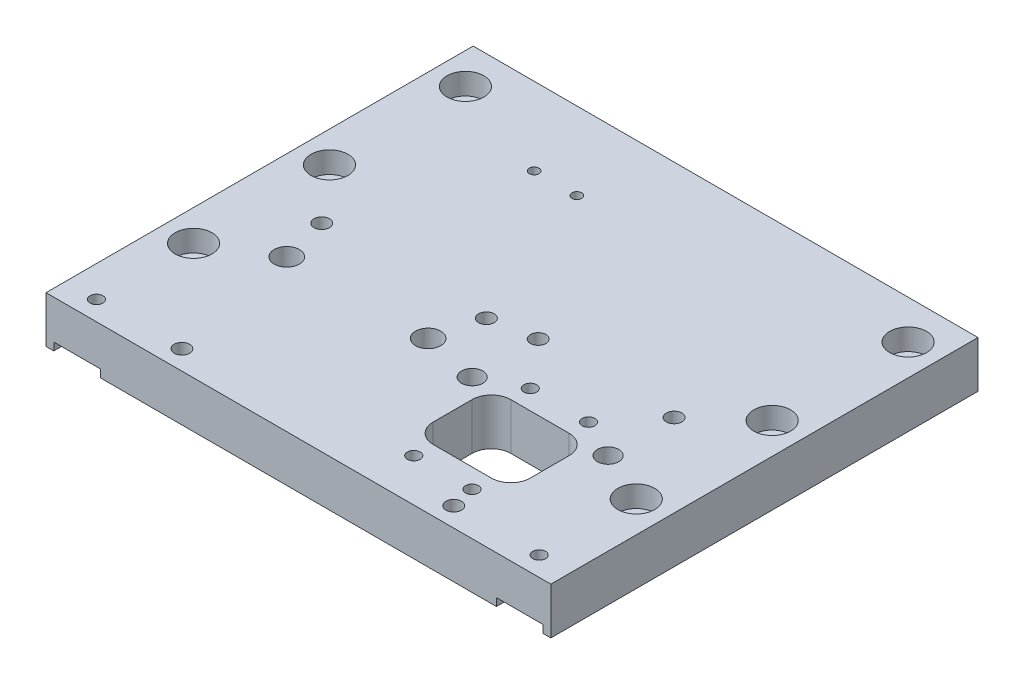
ISO-10303-21;
HEADER;
FILE_DESCRIPTION(('STEP AP214'),'2;1');
FILE_NAME('part.step','',(''),(''),'','','');
FILE_SCHEMA(('AUTOMOTIVE_DESIGN { 1 0 10303 214 1 1 1 1 }'));
ENDSEC;
DATA;
#1=APPLICATION_CONTEXT('core data for automotive mechanical design processes');
#2=APPLICATION_PROTOCOL_DEFINITION('international standard','automotive_design',2000,#1);
#3=PRODUCT_CONTEXT('',#1,'mechanical');
#4=PRODUCT('Part','Part','',(#3));
#5=PRODUCT_RELATED_PRODUCT_CATEGORY('part','',(#4));
#6=PRODUCT_DEFINITION_FORMATION('','',#4);
#7=PRODUCT_DEFINITION_CONTEXT('part definition',#1,'design');
#8=PRODUCT_DEFINITION('design','',#6,#7);
#9=PRODUCT_DEFINITION_SHAPE('','',#8);
#10=(LENGTH_UNIT() NAMED_UNIT(*) SI_UNIT(.MILLI.,.METRE.));
#11=(NAMED_UNIT(*) PLANE_ANGLE_UNIT() SI_UNIT($,.RADIAN.));
#12=(NAMED_UNIT(*) SI_UNIT($,.STERADIAN.) SOLID_ANGLE_UNIT());
#13=UNCERTAINTY_MEASURE_WITH_UNIT(LENGTH_MEASURE(1.E-05),#10,'distance_accuracy_value','');
#14=(GEOMETRIC_REPRESENTATION_CONTEXT(3) GLOBAL_UNCERTAINTY_ASSIGNED_CONTEXT((#13)) GLOBAL_UNIT_ASSIGNED_CONTEXT((#10,
#11,#12)) REPRESENTATION_CONTEXT('',''));
#15=CARTESIAN_POINT('',(0.,0.,0.));
#16=DIRECTION('',(0.,0.,1.));
#17=DIRECTION('',(1.,0.,0.));
#18=AXIS2_PLACEMENT_3D('',#15,#16,#17);
#19=CARTESIAN_POINT('',(108.700000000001,-97.9999999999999,73.9599999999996));
#20=DIRECTION('',(0.,1.,0.));
#21=DIRECTION('',(0.,0.,1.));
#22=AXIS2_PLACEMENT_3D('',#19,#20,#21);
#23=CYLINDRICAL_SURFACE('',#22,2.75);
#24=CARTESIAN_POINT('',(108.700000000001,12.0000000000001,73.9599999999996));
#25=DIRECTION('',(0.,1.,0.));
#26=DIRECTION('',(0.,0.,1.));
#27=AXIS2_PLACEMENT_3D('',#24,#25,#26);
#28=CIRCLE('',#27,2.75);
#29=CARTESIAN_POINT('',(108.700000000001,12.0000000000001,76.7099999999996));
#30=VERTEX_POINT('',#29);
#31=EDGE_CURVE('E307',#30,#30,#28,.T.);
#32=ORIENTED_EDGE('',*,*,#31,.T.);
#33=EDGE_LOOP('',(#32));
#34=FACE_BOUND('',#33,.T.);
#35=CARTESIAN_POINT('',(108.700000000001,6.50000000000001,73.9599999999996));
#36=DIRECTION('',(0.,-1.,0.));
#37=DIRECTION('',(0.,0.,-1.));
#38=AXIS2_PLACEMENT_3D('',#35,#36,#37);
#39=CIRCLE('',#38,2.75);
#40=CARTESIAN_POINT('',(108.700000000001,6.50000000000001,71.2099999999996));
#41=VERTEX_POINT('',#40);
#42=EDGE_CURVE('E36',#41,#41,#39,.F.);
#43=ORIENTED_EDGE('',*,*,#42,.F.);
#44=EDGE_LOOP('',(#43));
#45=FACE_BOUND('',#44,.T.);
#46=ADVANCED_FACE('F32',(#34,#45),#23,.F.);
#47=CARTESIAN_POINT('',(73.7000000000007,-97.9999999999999,73.9599999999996));
#48=DIRECTION('',(0.,1.,0.));
#49=DIRECTION('',(0.,0.,1.));
#50=AXIS2_PLACEMENT_3D('',#47,#48,#49);
#51=CYLINDRICAL_SURFACE('',#50,2.75);
#52=CARTESIAN_POINT('',(73.7000000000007,12.0000000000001,73.9599999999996));
#53=DIRECTION('',(0.,1.,0.));
#54=DIRECTION('',(0.,0.,1.));
#55=AXIS2_PLACEMENT_3D('',#52,#53,#54);
#56=CIRCLE('',#55,2.75);
#57=CARTESIAN_POINT('',(73.7000000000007,12.0000000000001,76.7099999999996));
#58=VERTEX_POINT('',#57);
#59=EDGE_CURVE('E310',#58,#58,#56,.T.);
#60=ORIENTED_EDGE('',*,*,#59,.T.);
#61=EDGE_LOOP('',(#60));
#62=FACE_BOUND('',#61,.T.);
#63=CARTESIAN_POINT('',(73.7000000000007,6.50000000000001,73.9599999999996));
#64=DIRECTION('',(0.,-1.,0.));
#65=DIRECTION('',(0.,0.,-1.));
#66=AXIS2_PLACEMENT_3D('',#63,#64,#65);
#67=CIRCLE('',#66,2.75);
#68=CARTESIAN_POINT('',(73.7000000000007,6.50000000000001,71.2099999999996));
#69=VERTEX_POINT('',#68);
#70=EDGE_CURVE('E452',#69,#69,#67,.F.);
#71=ORIENTED_EDGE('',*,*,#70,.F.);
#72=EDGE_LOOP('',(#71));
#73=FACE_BOUND('',#72,.T.);
#74=ADVANCED_FACE('F543',(#62,#73),#51,.F.);
#75=CARTESIAN_POINT('',(59.4000000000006,-97.9999999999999,71.));
#76=DIRECTION('',(0.,1.,0.));
#77=DIRECTION('',(0.,0.,1.));
#78=AXIS2_PLACEMENT_3D('',#75,#76,#77);
#79=CYLINDRICAL_SURFACE('',#78,3.25);
#80=CARTESIAN_POINT('',(59.4000000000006,12.0000000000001,71.));
#81=DIRECTION('',(0.,1.,0.));
#82=DIRECTION('',(0.,0.,1.));
#83=AXIS2_PLACEMENT_3D('',#80,#81,#82);
#84=CIRCLE('',#83,3.25);
#85=CARTESIAN_POINT('',(59.4000000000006,12.0000000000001,74.25));
#86=VERTEX_POINT('',#85);
#87=EDGE_CURVE('E325',#86,#86,#84,.T.);
#88=ORIENTED_EDGE('',*,*,#87,.T.);
#89=EDGE_LOOP('',(#88));
#90=FACE_BOUND('',#89,.T.);
#91=CARTESIAN_POINT('',(59.4000000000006,6.50000000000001,71.));
#92=DIRECTION('',(0.,-1.,0.));
#93=DIRECTION('',(0.,0.,-1.));
#94=AXIS2_PLACEMENT_3D('',#91,#92,#93);
#95=CIRCLE('',#94,3.25);
#96=CARTESIAN_POINT('',(59.4000000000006,6.50000000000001,67.75));
#97=VERTEX_POINT('',#96);
#98=EDGE_CURVE('E448',#97,#97,#95,.F.);
#99=ORIENTED_EDGE('',*,*,#98,.F.);
#100=EDGE_LOOP('',(#99));
#101=FACE_BOUND('',#100,.T.);
#102=ADVANCED_FACE('F549',(#90,#101),#79,.F.);
#103=CARTESIAN_POINT('',(23.,-97.9999999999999,71.));
#104=DIRECTION('',(0.,1.,0.));
#105=DIRECTION('',(0.,0.,1.));
#106=AXIS2_PLACEMENT_3D('',#103,#104,#105);
#107=CYLINDRICAL_SURFACE('',#106,3.25);
#108=CARTESIAN_POINT('',(23.,12.0000000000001,71.));
#109=DIRECTION('',(0.,1.,0.));
#110=DIRECTION('',(0.,0.,1.));
#111=AXIS2_PLACEMENT_3D('',#108,#109,#110);
#112=CIRCLE('',#111,3.25);
#113=CARTESIAN_POINT('',(23.,12.0000000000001,74.25));
#114=VERTEX_POINT('',#113);
#115=EDGE_CURVE('E328',#114,#114,#112,.T.);
#116=ORIENTED_EDGE('',*,*,#115,.T.);
#117=EDGE_LOOP('',(#116));
#118=FACE_BOUND('',#117,.T.);
#119=CARTESIAN_POINT('',(23.,6.50000000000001,71.));
#120=DIRECTION('',(0.,-1.,0.));
#121=DIRECTION('',(0.,0.,-1.));
#122=AXIS2_PLACEMENT_3D('',#119,#120,#121);
#123=CIRCLE('',#122,3.25);
#124=CARTESIAN_POINT('',(23.,6.50000000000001,67.75));
#125=VERTEX_POINT('',#124);
#126=EDGE_CURVE('E443',#125,#125,#123,.F.);
#127=ORIENTED_EDGE('',*,*,#126,.F.);
#128=EDGE_LOOP('',(#127));
#129=FACE_BOUND('',#128,.T.);
#130=ADVANCED_FACE('F568',(#118,#129),#107,.F.);
#131=CARTESIAN_POINT('',(122.000000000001,-97.9999999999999,10.));
#132=DIRECTION('',(0.,1.,0.));
#133=DIRECTION('',(0.,0.,1.));
#134=AXIS2_PLACEMENT_3D('',#131,#132,#133);
#135=CYLINDRICAL_SURFACE('',#134,2.75);
#136=CARTESIAN_POINT('',(122.000000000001,2.00000000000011,10.));
#137=DIRECTION('',(0.,1.,0.));
#138=DIRECTION('',(0.,0.,1.));
#139=AXIS2_PLACEMENT_3D('',#136,#137,#138);
#140=CIRCLE('',#139,2.75);
#141=CARTESIAN_POINT('',(122.000000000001,2.00000000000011,12.75));
#142=VERTEX_POINT('',#141);
#143=EDGE_CURVE('E241',#142,#142,#140,.T.);
#144=ORIENTED_EDGE('',*,*,#143,.F.);
#145=EDGE_LOOP('',(#144));
#146=FACE_BOUND('',#145,.T.);
#147=CARTESIAN_POINT('',(122.000000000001,6.50000000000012,10.));
#148=DIRECTION('',(0.,1.,0.));
#149=DIRECTION('',(0.,0.,1.));
#150=AXIS2_PLACEMENT_3D('',#147,#148,#149);
#151=CIRCLE('',#150,2.75);
#152=CARTESIAN_POINT('',(122.000000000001,6.50000000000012,12.75));
#153=VERTEX_POINT('',#152);
#154=EDGE_CURVE('E438',#153,#153,#151,.F.);
#155=ORIENTED_EDGE('',*,*,#154,.F.);
#156=EDGE_LOOP('',(#155));
#157=FACE_BOUND('',#156,.T.);
#158=ADVANCED_FACE('F572',(#146,#157),#135,.F.);
#159=CARTESIAN_POINT('',(122.000000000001,-97.9999999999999,45.));
#160=DIRECTION('',(0.,1.,0.));
#161=DIRECTION('',(0.,0.,1.));
#162=AXIS2_PLACEMENT_3D('',#159,#160,#161);
#163=CYLINDRICAL_SURFACE('',#162,2.75);
#164=CARTESIAN_POINT('',(122.000000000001,2.00000000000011,45.));
#165=DIRECTION('',(0.,1.,0.));
#166=DIRECTION('',(0.,0.,1.));
#167=AXIS2_PLACEMENT_3D('',#164,#165,#166);
#168=CIRCLE('',#167,2.75);
#169=CARTESIAN_POINT('',(122.000000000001,2.00000000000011,47.75));
#170=VERTEX_POINT('',#169);
#171=EDGE_CURVE('E244',#170,#170,#168,.T.);
#172=ORIENTED_EDGE('',*,*,#171,.F.);
#173=EDGE_LOOP('',(#172));
#174=FACE_BOUND('',#173,.T.);
#175=CARTESIAN_POINT('',(122.000000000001,6.50000000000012,45.));
#176=DIRECTION('',(0.,1.,0.));
#177=DIRECTION('',(0.,0.,1.));
#178=AXIS2_PLACEMENT_3D('',#175,#176,#177);
#179=CIRCLE('',#178,2.75);
#180=CARTESIAN_POINT('',(122.000000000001,6.50000000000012,47.75));
#181=VERTEX_POINT('',#180);
#182=EDGE_CURVE('E433',#181,#181,#179,.F.);
#183=ORIENTED_EDGE('',*,*,#182,.F.);
#184=EDGE_LOOP('',(#183));
#185=FACE_BOUND('',#184,.T.);
#186=ADVANCED_FACE('F1199',(#174,#185),#163,.F.);
#187=CARTESIAN_POINT('',(122.000000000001,-97.9999999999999,80.));
#188=DIRECTION('',(0.,1.,0.));
#189=DIRECTION('',(0.,0.,1.));
#190=AXIS2_PLACEMENT_3D('',#187,#188,#189);
#191=CYLINDRICAL_SURFACE('',#190,2.75);
#192=CARTESIAN_POINT('',(122.000000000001,2.00000000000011,80.));
#193=DIRECTION('',(0.,1.,0.));
#194=DIRECTION('',(0.,0.,1.));
#195=AXIS2_PLACEMENT_3D('',#192,#193,#194);
#196=CIRCLE('',#195,2.75);
#197=CARTESIAN_POINT('',(122.000000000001,2.00000000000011,82.75));
#198=VERTEX_POINT('',#197);
#199=EDGE_CURVE('E247',#198,#198,#196,.T.);
#200=ORIENTED_EDGE('',*,*,#199,.F.);
#201=EDGE_LOOP('',(#200));
#202=FACE_BOUND('',#201,.T.);
#203=CARTESIAN_POINT('',(122.000000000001,6.50000000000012,80.));
#204=DIRECTION('',(0.,1.,0.));
#205=DIRECTION('',(0.,0.,1.));
#206=AXIS2_PLACEMENT_3D('',#203,#204,#205);
#207=CIRCLE('',#206,2.75);
#208=CARTESIAN_POINT('',(122.000000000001,6.50000000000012,82.75));
#209=VERTEX_POINT('',#208);
#210=EDGE_CURVE('E428',#209,#209,#207,.F.);
#211=ORIENTED_EDGE('',*,*,#210,.F.);
#212=EDGE_LOOP('',(#211));
#213=FACE_BOUND('',#212,.T.);
#214=ADVANCED_FACE('F1191',(#202,#213),#191,.F.);
#215=CARTESIAN_POINT('',(8.,-97.9999999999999,80.));
#216=DIRECTION('',(0.,1.,0.));
#217=DIRECTION('',(0.,0.,1.));
#218=AXIS2_PLACEMENT_3D('',#215,#216,#217);
#219=CYLINDRICAL_SURFACE('',#218,2.75);
#220=CARTESIAN_POINT('',(8.,2.00000000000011,80.));
#221=DIRECTION('',(0.,1.,0.));
#222=DIRECTION('',(0.,0.,1.));
#223=AXIS2_PLACEMENT_3D('',#220,#221,#222);
#224=CIRCLE('',#223,2.75);
#225=CARTESIAN_POINT('',(8.,2.00000000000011,82.75));
#226=VERTEX_POINT('',#225);
#227=EDGE_CURVE('E250',#226,#226,#224,.T.);
#228=ORIENTED_EDGE('',*,*,#227,.F.);
#229=EDGE_LOOP('',(#228));
#230=FACE_BOUND('',#229,.T.);
#231=CARTESIAN_POINT('',(8.,6.50000000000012,80.));
#232=DIRECTION('',(0.,1.,0.));
#233=DIRECTION('',(0.,0.,1.));
#234=AXIS2_PLACEMENT_3D('',#231,#232,#233);
#235=CIRCLE('',#234,2.75);
#236=CARTESIAN_POINT('',(8.,6.50000000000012,82.75));
#237=VERTEX_POINT('',#236);
#238=EDGE_CURVE('E423',#237,#237,#235,.F.);
#239=ORIENTED_EDGE('',*,*,#238,.F.);
#240=EDGE_LOOP('',(#239));
#241=FACE_BOUND('',#240,.T.);
#242=ADVANCED_FACE('F673',(#230,#241),#219,.F.);
#243=CARTESIAN_POINT('',(8.,-97.9999999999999,45.));
#244=DIRECTION('',(0.,1.,0.));
#245=DIRECTION('',(0.,0.,1.));
#246=AXIS2_PLACEMENT_3D('',#243,#244,#245);
#247=CYLINDRICAL_SURFACE('',#246,2.75);
#248=CARTESIAN_POINT('',(8.,2.00000000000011,45.));
#249=DIRECTION('',(0.,1.,0.));
#250=DIRECTION('',(0.,0.,1.));
#251=AXIS2_PLACEMENT_3D('',#248,#249,#250);
#252=CIRCLE('',#251,2.75);
#253=CARTESIAN_POINT('',(8.,2.00000000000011,47.75));
#254=VERTEX_POINT('',#253);
#255=EDGE_CURVE('E253',#254,#254,#252,.T.);
#256=ORIENTED_EDGE('',*,*,#255,.F.);
#257=EDGE_LOOP('',(#256));
#258=FACE_BOUND('',#257,.T.);
#259=CARTESIAN_POINT('',(8.,6.50000000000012,45.));
#260=DIRECTION('',(0.,1.,0.));
#261=DIRECTION('',(0.,0.,1.));
#262=AXIS2_PLACEMENT_3D('',#259,#260,#261);
#263=CIRCLE('',#262,2.75);
#264=CARTESIAN_POINT('',(8.,6.50000000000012,47.75));
#265=VERTEX_POINT('',#264);
#266=EDGE_CURVE('E418',#265,#265,#263,.F.);
#267=ORIENTED_EDGE('',*,*,#266,.F.);
#268=EDGE_LOOP('',(#267));
#269=FACE_BOUND('',#268,.T.);
#270=ADVANCED_FACE('F667',(#258,#269),#247,.F.);
#271=CARTESIAN_POINT('',(8.,-97.9999999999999,10.));
#272=DIRECTION('',(0.,1.,0.));
#273=DIRECTION('',(0.,0.,1.));
#274=AXIS2_PLACEMENT_3D('',#271,#272,#273);
#275=CYLINDRICAL_SURFACE('',#274,2.75);
#276=CARTESIAN_POINT('',(8.,2.00000000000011,10.));
#277=DIRECTION('',(0.,1.,0.));
#278=DIRECTION('',(0.,0.,1.));
#279=AXIS2_PLACEMENT_3D('',#276,#277,#278);
#280=CIRCLE('',#279,2.75);
#281=CARTESIAN_POINT('',(8.,2.00000000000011,12.75));
#282=VERTEX_POINT('',#281);
#283=EDGE_CURVE('E256',#282,#282,#280,.T.);
#284=ORIENTED_EDGE('',*,*,#283,.F.);
#285=EDGE_LOOP('',(#284));
#286=FACE_BOUND('',#285,.T.);
#287=CARTESIAN_POINT('',(8.,6.50000000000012,10.));
#288=DIRECTION('',(0.,1.,0.));
#289=DIRECTION('',(0.,0.,1.));
#290=AXIS2_PLACEMENT_3D('',#287,#288,#289);
#291=CIRCLE('',#290,2.75);
#292=CARTESIAN_POINT('',(8.,6.50000000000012,12.75));
#293=VERTEX_POINT('',#292);
#294=EDGE_CURVE('E413',#293,#293,#291,.F.);
#295=ORIENTED_EDGE('',*,*,#294,.F.);
#296=EDGE_LOOP('',(#295));
#297=FACE_BOUND('',#296,.T.);
#298=ADVANCED_FACE('F624',(#286,#297),#275,.F.);
#299=CARTESIAN_POINT('',(0.,1.13686837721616E-13,110.));
#300=DIRECTION('',(1.,0.,0.));
#301=DIRECTION('',(0.,0.,-1.));
#302=AXIS2_PLACEMENT_3D('',#299,#300,#301);
#303=PLANE('',#302);
#304=DIRECTION('',(0.,-1.,0.));
#305=VECTOR('',#304,1.);
#306=CARTESIAN_POINT('',(0.,1.13686837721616E-13,0.));
#307=LINE('',#306,#305);
#308=CARTESIAN_POINT('',(0.,12.0000000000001,0.));
#309=VERTEX_POINT('',#308);
#310=CARTESIAN_POINT('',(0.,1.13686837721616E-13,0.));
#311=VERTEX_POINT('',#310);
#312=EDGE_CURVE('E331',#309,#311,#307,.T.);
#313=ORIENTED_EDGE('',*,*,#312,.T.);
#314=DIRECTION('',(0.,0.,-1.));
#315=VECTOR('',#314,1.);
#316=CARTESIAN_POINT('',(0.,1.13686837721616E-13,110.));
#317=LINE('',#316,#315);
#318=CARTESIAN_POINT('',(0.,1.13686837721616E-13,110.));
#319=VERTEX_POINT('',#318);
#320=EDGE_CURVE('E11',#319,#311,#317,.T.);
#321=ORIENTED_EDGE('',*,*,#320,.F.);
#322=DIRECTION('',(0.,-1.,0.));
#323=VECTOR('',#322,1.);
#324=CARTESIAN_POINT('',(0.,1.13686837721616E-13,110.));
#325=LINE('',#324,#323);
#326=CARTESIAN_POINT('',(0.,12.0000000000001,110.));
#327=VERTEX_POINT('',#326);
#328=EDGE_CURVE('E332',#327,#319,#325,.T.);
#329=ORIENTED_EDGE('',*,*,#328,.F.);
#330=DIRECTION('',(0.,0.,-1.));
#331=VECTOR('',#330,1.);
#332=CARTESIAN_POINT('',(0.,12.0000000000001,110.));
#333=LINE('',#332,#331);
#334=EDGE_CURVE('E358',#327,#309,#333,.T.);
#335=ORIENTED_EDGE('',*,*,#334,.T.);
#336=EDGE_LOOP('',(#313,#321,#329,#335));
#337=FACE_BOUND('',#336,.T.);
#338=ADVANCED_FACE('F34',(#337),#303,.F.);
#339=CARTESIAN_POINT('',(0.,1.13686837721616E-13,110.));
#340=DIRECTION('',(0.,1.,0.));
#341=DIRECTION('',(0.,0.,1.));
#342=AXIS2_PLACEMENT_3D('',#339,#340,#341);
#343=PLANE('',#342);
#344=DIRECTION('',(1.,0.,0.));
#345=VECTOR('',#344,1.);
#346=CARTESIAN_POINT('',(0.,1.13686837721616E-13,0.));
#347=LINE('',#346,#345);
#348=CARTESIAN_POINT('',(2.,1.13686837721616E-13,0.));
#349=VERTEX_POINT('',#348);
#350=EDGE_CURVE('E361',#311,#349,#347,.T.);
#351=ORIENTED_EDGE('',*,*,#350,.T.);
#352=DIRECTION('',(0.,0.,-1.));
#353=VECTOR('',#352,1.);
#354=CARTESIAN_POINT('',(2.,1.13686837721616E-13,110.));
#355=LINE('',#354,#353);
#356=CARTESIAN_POINT('',(2.,1.13686837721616E-13,110.));
#357=VERTEX_POINT('',#356);
#358=EDGE_CURVE('E41',#357,#349,#355,.T.);
#359=ORIENTED_EDGE('',*,*,#358,.F.);
#360=DIRECTION('',(1.,0.,0.));
#361=VECTOR('',#360,1.);
#362=CARTESIAN_POINT('',(0.,1.13686837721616E-13,110.));
#363=LINE('',#362,#361);
#364=EDGE_CURVE('E335',#319,#357,#363,.T.);
#365=ORIENTED_EDGE('',*,*,#364,.F.);
#366=ORIENTED_EDGE('',*,*,#320,.T.);
#367=EDGE_LOOP('',(#351,#359,#365,#366));
#368=FACE_BOUND('',#367,.T.);
#369=ADVANCED_FACE('F617',(#368),#343,.F.);
#370=CARTESIAN_POINT('',(2.,2.00000000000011,110.));
#371=DIRECTION('',(-1.,0.,0.));
#372=DIRECTION('',(0.,0.,1.));
#373=AXIS2_PLACEMENT_3D('',#370,#371,#372);
#374=PLANE('',#373);
#375=DIRECTION('',(0.,1.,0.));
#376=VECTOR('',#375,1.);
#377=CARTESIAN_POINT('',(2.,2.00000000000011,0.));
#378=LINE('',#377,#376);
#379=CARTESIAN_POINT('',(2.,2.00000000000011,0.));
#380=VERTEX_POINT('',#379);
#381=EDGE_CURVE('E363',#349,#380,#378,.T.);
#382=ORIENTED_EDGE('',*,*,#381,.T.);
#383=DIRECTION('',(0.,0.,-1.));
#384=VECTOR('',#383,1.);
#385=CARTESIAN_POINT('',(2.,2.00000000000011,110.));
#386=LINE('',#385,#384);
#387=CARTESIAN_POINT('',(2.,2.00000000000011,110.));
#388=VERTEX_POINT('',#387);
#389=EDGE_CURVE('E408',#388,#380,#386,.T.);
#390=ORIENTED_EDGE('',*,*,#389,.F.);
#391=DIRECTION('',(0.,1.,0.));
#392=VECTOR('',#391,1.);
#393=CARTESIAN_POINT('',(2.,2.00000000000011,110.));
#394=LINE('',#393,#392);
#395=EDGE_CURVE('E338',#357,#388,#394,.T.);
#396=ORIENTED_EDGE('',*,*,#395,.F.);
#397=ORIENTED_EDGE('',*,*,#358,.T.);
#398=EDGE_LOOP('',(#382,#390,#396,#397));
#399=FACE_BOUND('',#398,.T.);
#400=ADVANCED_FACE('F614',(#399),#374,.F.);
#401=CARTESIAN_POINT('',(2.,2.00000000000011,110.));
#402=DIRECTION('',(0.,1.,0.));
#403=DIRECTION('',(0.,0.,1.));
#404=AXIS2_PLACEMENT_3D('',#401,#402,#403);
#405=PLANE('',#404);
#406=ORIENTED_EDGE('',*,*,#227,.T.);
#407=EDGE_LOOP('',(#406));
#408=FACE_BOUND('',#407,.T.);
#409=ORIENTED_EDGE('',*,*,#255,.T.);
#410=EDGE_LOOP('',(#409));
#411=FACE_BOUND('',#410,.T.);
#412=ORIENTED_EDGE('',*,*,#283,.T.);
#413=EDGE_LOOP('',(#412));
#414=FACE_BOUND('',#413,.T.);
#415=CARTESIAN_POINT('',(8.,2.00000000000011,105.));
#416=DIRECTION('',(0.,1.,0.));
#417=DIRECTION('',(0.,0.,1.));
#418=AXIS2_PLACEMENT_3D('',#415,#416,#417);
#419=CIRCLE('',#418,1.65);
#420=CARTESIAN_POINT('',(8.,2.00000000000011,106.65));
#421=VERTEX_POINT('',#420);
#422=EDGE_CURVE('E280',#421,#421,#419,.T.);
#423=ORIENTED_EDGE('',*,*,#422,.T.);
#424=EDGE_LOOP('',(#423));
#425=FACE_BOUND('',#424,.T.);
#426=DIRECTION('',(1.,0.,0.));
#427=VECTOR('',#426,1.);
#428=CARTESIAN_POINT('',(2.,2.00000000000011,0.));
#429=LINE('',#428,#427);
#430=CARTESIAN_POINT('',(14.,2.00000000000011,0.));
#431=VERTEX_POINT('',#430);
#432=EDGE_CURVE('E365',#380,#431,#429,.T.);
#433=ORIENTED_EDGE('',*,*,#432,.T.);
#434=DIRECTION('',(0.,0.,-1.));
#435=VECTOR('',#434,1.);
#436=CARTESIAN_POINT('',(14.,2.00000000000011,110.));
#437=LINE('',#436,#435);
#438=CARTESIAN_POINT('',(14.,2.00000000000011,110.));
#439=VERTEX_POINT('',#438);
#440=EDGE_CURVE('E405',#439,#431,#437,.T.);
#441=ORIENTED_EDGE('',*,*,#440,.F.);
#442=DIRECTION('',(1.,0.,0.));
#443=VECTOR('',#442,1.);
#444=CARTESIAN_POINT('',(2.,2.00000000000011,110.));
#445=LINE('',#444,#443);
#446=EDGE_CURVE('E340',#388,#439,#445,.T.);
#447=ORIENTED_EDGE('',*,*,#446,.F.);
#448=ORIENTED_EDGE('',*,*,#389,.T.);
#449=EDGE_LOOP('',(#433,#441,#447,#448));
#450=FACE_BOUND('',#449,.T.);
#451=ADVANCED_FACE('F610',(#408,#411,#414,#425,#450),#405,.F.);
#452=CARTESIAN_POINT('',(14.,2.00000000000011,110.));
#453=DIRECTION('',(1.,0.,0.));
#454=DIRECTION('',(0.,0.,-1.));
#455=AXIS2_PLACEMENT_3D('',#452,#453,#454);
#456=PLANE('',#455);
#457=DIRECTION('',(0.,-1.,0.));
#458=VECTOR('',#457,1.);
#459=CARTESIAN_POINT('',(14.,2.00000000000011,0.));
#460=LINE('',#459,#458);
#461=CARTESIAN_POINT('',(14.,1.13686837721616E-13,0.));
#462=VERTEX_POINT('',#461);
#463=EDGE_CURVE('E367',#431,#462,#460,.T.);
#464=ORIENTED_EDGE('',*,*,#463,.T.);
#465=DIRECTION('',(0.,0.,-1.));
#466=VECTOR('',#465,1.);
#467=CARTESIAN_POINT('',(14.,1.13686837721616E-13,110.));
#468=LINE('',#467,#466);
#469=CARTESIAN_POINT('',(14.,1.13686837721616E-13,110.));
#470=VERTEX_POINT('',#469);
#471=EDGE_CURVE('E402',#470,#462,#468,.T.);
#472=ORIENTED_EDGE('',*,*,#471,.F.);
#473=DIRECTION('',(0.,-1.,0.));
#474=VECTOR('',#473,1.);
#475=CARTESIAN_POINT('',(14.,2.00000000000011,110.));
#476=LINE('',#475,#474);
#477=EDGE_CURVE('E342',#439,#470,#476,.T.);
#478=ORIENTED_EDGE('',*,*,#477,.F.);
#479=ORIENTED_EDGE('',*,*,#440,.T.);
#480=EDGE_LOOP('',(#464,#472,#478,#479));
#481=FACE_BOUND('',#480,.T.);
#482=ADVANCED_FACE('F606',(#481),#456,.F.);
#483=CARTESIAN_POINT('',(14.,1.13686837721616E-13,110.));
#484=DIRECTION('',(0.,1.,0.));
#485=DIRECTION('',(0.,0.,1.));
#486=AXIS2_PLACEMENT_3D('',#483,#484,#485);
#487=PLANE('',#486);
#488=CARTESIAN_POINT('',(108.700000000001,0.,73.9599999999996));
#489=DIRECTION('',(0.,-1.,0.));
#490=DIRECTION('',(0.,0.,-1.));
#491=AXIS2_PLACEMENT_3D('',#488,#489,#490);
#492=CIRCLE('',#491,4.75000000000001);
#493=CARTESIAN_POINT('',(108.700000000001,0.,69.2099999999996));
#494=VERTEX_POINT('',#493);
#495=EDGE_CURVE('E468',#494,#494,#492,.T.);
#496=ORIENTED_EDGE('',*,*,#495,.F.);
#497=EDGE_LOOP('',(#496));
#498=FACE_BOUND('',#497,.T.);
#499=CARTESIAN_POINT('',(73.7000000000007,0.,73.9599999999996));
#500=DIRECTION('',(0.,-1.,0.));
#501=DIRECTION('',(0.,0.,-1.));
#502=AXIS2_PLACEMENT_3D('',#499,#500,#501);
#503=CIRCLE('',#502,4.74999999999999);
#504=CARTESIAN_POINT('',(73.7000000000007,0.,69.2099999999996));
#505=VERTEX_POINT('',#504);
#506=EDGE_CURVE('E461',#505,#505,#503,.T.);
#507=ORIENTED_EDGE('',*,*,#506,.F.);
#508=EDGE_LOOP('',(#507));
#509=FACE_BOUND('',#508,.T.);
#510=CARTESIAN_POINT('',(59.4000000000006,0.,71.));
#511=DIRECTION('',(0.,-1.,0.));
#512=DIRECTION('',(0.,0.,-1.));
#513=AXIS2_PLACEMENT_3D('',#510,#511,#512);
#514=CIRCLE('',#513,5.5);
#515=CARTESIAN_POINT('',(59.4000000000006,0.,65.5));
#516=VERTEX_POINT('',#515);
#517=EDGE_CURVE('E454',#516,#516,#514,.T.);
#518=ORIENTED_EDGE('',*,*,#517,.F.);
#519=EDGE_LOOP('',(#518));
#520=FACE_BOUND('',#519,.T.);
#521=CARTESIAN_POINT('',(23.,0.,71.));
#522=DIRECTION('',(0.,-1.,0.));
#523=DIRECTION('',(0.,0.,-1.));
#524=AXIS2_PLACEMENT_3D('',#521,#522,#523);
#525=CIRCLE('',#524,5.49999999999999);
#526=CARTESIAN_POINT('',(23.,0.,65.5));
#527=VERTEX_POINT('',#526);
#528=EDGE_CURVE('E450',#527,#527,#525,.T.);
#529=ORIENTED_EDGE('',*,*,#528,.F.);
#530=EDGE_LOOP('',(#529));
#531=FACE_BOUND('',#530,.T.);
#532=CARTESIAN_POINT('',(83.7000000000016,1.11022302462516E-13,99.));
#533=DIRECTION('',(0.,1.,0.));
#534=DIRECTION('',(0.,0.,1.));
#535=AXIS2_PLACEMENT_3D('',#532,#533,#534);
#536=CIRCLE('',#535,1.65);
#537=CARTESIAN_POINT('',(83.7000000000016,1.11022302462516E-13,100.65));
#538=VERTEX_POINT('',#537);
#539=EDGE_CURVE('E503',#538,#538,#536,.T.);
#540=ORIENTED_EDGE('',*,*,#539,.T.);
#541=EDGE_LOOP('',(#540));
#542=FACE_BOUND('',#541,.T.);
#543=CARTESIAN_POINT('',(98.7000000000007,1.11022302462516E-13,99.));
#544=DIRECTION('',(0.,1.,0.));
#545=DIRECTION('',(0.,0.,1.));
#546=AXIS2_PLACEMENT_3D('',#543,#544,#545);
#547=CIRCLE('',#546,1.65);
#548=CARTESIAN_POINT('',(98.7000000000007,1.11022302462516E-13,100.65));
#549=VERTEX_POINT('',#548);
#550=EDGE_CURVE('E509',#549,#549,#547,.T.);
#551=ORIENTED_EDGE('',*,*,#550,.T.);
#552=EDGE_LOOP('',(#551));
#553=FACE_BOUND('',#552,.T.);
#554=CARTESIAN_POINT('',(98.7000000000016,1.11022302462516E-13,69.));
#555=DIRECTION('',(0.,1.,0.));
#556=DIRECTION('',(0.,0.,1.));
#557=AXIS2_PLACEMENT_3D('',#554,#555,#556);
#558=CIRCLE('',#557,1.65);
#559=CARTESIAN_POINT('',(98.7000000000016,1.11022302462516E-13,70.65));
#560=VERTEX_POINT('',#559);
#561=EDGE_CURVE('E515',#560,#560,#558,.T.);
#562=ORIENTED_EDGE('',*,*,#561,.T.);
#563=EDGE_LOOP('',(#562));
#564=FACE_BOUND('',#563,.T.);
#565=CARTESIAN_POINT('',(83.7000000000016,1.11022302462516E-13,69.));
#566=DIRECTION('',(0.,1.,0.));
#567=DIRECTION('',(0.,0.,1.));
#568=AXIS2_PLACEMENT_3D('',#565,#566,#567);
#569=CIRCLE('',#568,1.65);
#570=CARTESIAN_POINT('',(83.7000000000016,1.11022302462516E-13,70.65));
#571=VERTEX_POINT('',#570);
#572=EDGE_CURVE('E521',#571,#571,#569,.T.);
#573=ORIENTED_EDGE('',*,*,#572,.T.);
#574=EDGE_LOOP('',(#573));
#575=FACE_BOUND('',#574,.T.);
#576=DIRECTION('',(0.,0.,1.));
#577=VECTOR('',#576,1.);
#578=CARTESIAN_POINT('',(78.7000000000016,1.13686837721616E-13,110.));
#579=LINE('',#578,#577);
#580=CARTESIAN_POINT('',(78.7000000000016,1.11022302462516E-13,79.));
#581=VERTEX_POINT('',#580);
#582=CARTESIAN_POINT('',(78.7000000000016,1.11022302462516E-13,89.));
#583=VERTEX_POINT('',#582);
#584=EDGE_CURVE('E235',#581,#583,#579,.T.);
#585=ORIENTED_EDGE('',*,*,#584,.T.);
#586=CARTESIAN_POINT('',(83.7000000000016,1.11022302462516E-13,89.));
#587=DIRECTION('',(0.,1.,0.));
#588=DIRECTION('',(0.,0.,1.));
#589=AXIS2_PLACEMENT_3D('',#586,#587,#588);
#590=CIRCLE('',#589,5.);
#591=CARTESIAN_POINT('',(83.7000000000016,1.11022302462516E-13,94.));
#592=VERTEX_POINT('',#591);
#593=EDGE_CURVE('E238',#583,#592,#590,.T.);
#594=ORIENTED_EDGE('',*,*,#593,.T.);
#595=DIRECTION('',(1.,0.,0.));
#596=VECTOR('',#595,1.);
#597=CARTESIAN_POINT('',(14.,1.13686837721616E-13,94.));
#598=LINE('',#597,#596);
#599=CARTESIAN_POINT('',(98.7000000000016,1.13686837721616E-13,94.));
#600=VERTEX_POINT('',#599);
#601=EDGE_CURVE('E210',#592,#600,#598,.T.);
#602=ORIENTED_EDGE('',*,*,#601,.T.);
#603=CARTESIAN_POINT('',(98.7000000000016,1.11022302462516E-13,89.));
#604=DIRECTION('',(0.,1.,0.));
#605=DIRECTION('',(0.,0.,1.));
#606=AXIS2_PLACEMENT_3D('',#603,#604,#605);
#607=CIRCLE('',#606,5.);
#608=CARTESIAN_POINT('',(103.700000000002,1.11022302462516E-13,89.));
#609=VERTEX_POINT('',#608);
#610=EDGE_CURVE('E177',#600,#609,#607,.T.);
#611=ORIENTED_EDGE('',*,*,#610,.T.);
#612=DIRECTION('',(0.,0.,-1.));
#613=VECTOR('',#612,1.);
#614=CARTESIAN_POINT('',(103.700000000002,1.13686837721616E-13,110.));
#615=LINE('',#614,#613);
#616=CARTESIAN_POINT('',(103.700000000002,1.11022302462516E-13,79.));
#617=VERTEX_POINT('',#616);
#618=EDGE_CURVE('E223',#609,#617,#615,.T.);
#619=ORIENTED_EDGE('',*,*,#618,.T.);
#620=CARTESIAN_POINT('',(98.7000000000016,1.11022302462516E-13,79.));
#621=DIRECTION('',(0.,1.,0.));
#622=DIRECTION('',(0.,0.,1.));
#623=AXIS2_PLACEMENT_3D('',#620,#621,#622);
#624=CIRCLE('',#623,5.);
#625=CARTESIAN_POINT('',(98.7000000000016,1.11022302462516E-13,74.));
#626=VERTEX_POINT('',#625);
#627=EDGE_CURVE('E226',#617,#626,#624,.T.);
#628=ORIENTED_EDGE('',*,*,#627,.T.);
#629=DIRECTION('',(-1.,0.,0.));
#630=VECTOR('',#629,1.);
#631=CARTESIAN_POINT('',(14.,1.13686837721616E-13,74.));
#632=LINE('',#631,#630);
#633=CARTESIAN_POINT('',(83.7000000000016,1.11022302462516E-13,74.));
#634=VERTEX_POINT('',#633);
#635=EDGE_CURVE('E229',#626,#634,#632,.T.);
#636=ORIENTED_EDGE('',*,*,#635,.T.);
#637=CARTESIAN_POINT('',(83.7000000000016,1.11022302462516E-13,79.));
#638=DIRECTION('',(0.,1.,0.));
#639=DIRECTION('',(0.,0.,1.));
#640=AXIS2_PLACEMENT_3D('',#637,#638,#639);
#641=CIRCLE('',#640,5.);
#642=EDGE_CURVE('E232',#634,#581,#641,.T.);
#643=ORIENTED_EDGE('',*,*,#642,.T.);
#644=EDGE_LOOP('',(#585,#594,#602,#611,#619,#628,#636,#643));
#645=FACE_BOUND('',#644,.T.);
#646=CARTESIAN_POINT('',(100.000000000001,1.11022302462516E-13,105.));
#647=DIRECTION('',(0.,1.,0.));
#648=DIRECTION('',(0.,0.,1.));
#649=AXIS2_PLACEMENT_3D('',#646,#647,#648);
#650=CIRCLE('',#649,2.00000000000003);
#651=CARTESIAN_POINT('',(100.000000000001,1.11022302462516E-13,107.));
#652=VERTEX_POINT('',#651);
#653=EDGE_CURVE('E262',#652,#652,#650,.T.);
#654=ORIENTED_EDGE('',*,*,#653,.T.);
#655=EDGE_LOOP('',(#654));
#656=FACE_BOUND('',#655,.T.);
#657=CARTESIAN_POINT('',(30.,1.11022302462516E-13,105.));
#658=DIRECTION('',(0.,1.,0.));
#659=DIRECTION('',(0.,0.,1.));
#660=AXIS2_PLACEMENT_3D('',#657,#658,#659);
#661=CIRCLE('',#660,2.00000000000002);
#662=CARTESIAN_POINT('',(30.,1.11022302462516E-13,107.));
#663=VERTEX_POINT('',#662);
#664=EDGE_CURVE('E268',#663,#663,#661,.T.);
#665=ORIENTED_EDGE('',*,*,#664,.T.);
#666=EDGE_LOOP('',(#665));
#667=FACE_BOUND('',#666,.T.);
#668=CARTESIAN_POINT('',(46.7000000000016,1.11022302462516E-13,20.));
#669=DIRECTION('',(0.,1.,0.));
#670=DIRECTION('',(0.,0.,1.));
#671=AXIS2_PLACEMENT_3D('',#668,#669,#670);
#672=CIRCLE('',#671,1.25);
#673=CARTESIAN_POINT('',(46.7000000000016,1.11022302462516E-13,21.25));
#674=VERTEX_POINT('',#673);
#675=EDGE_CURVE('E286',#674,#674,#672,.T.);
#676=ORIENTED_EDGE('',*,*,#675,.T.);
#677=EDGE_LOOP('',(#676));
#678=FACE_BOUND('',#677,.T.);
#679=CARTESIAN_POINT('',(35.7000000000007,1.11022302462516E-13,20.));
#680=DIRECTION('',(0.,1.,0.));
#681=DIRECTION('',(0.,0.,1.));
#682=AXIS2_PLACEMENT_3D('',#679,#680,#681);
#683=CIRCLE('',#682,1.25);
#684=CARTESIAN_POINT('',(35.7000000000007,1.11022302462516E-13,21.25));
#685=VERTEX_POINT('',#684);
#686=EDGE_CURVE('E292',#685,#685,#683,.T.);
#687=ORIENTED_EDGE('',*,*,#686,.T.);
#688=EDGE_LOOP('',(#687));
#689=FACE_BOUND('',#688,.T.);
#690=CARTESIAN_POINT('',(73.7000000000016,1.11022302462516E-13,56.9599999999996));
#691=DIRECTION('',(0.,1.,0.));
#692=DIRECTION('',(0.,0.,1.));
#693=AXIS2_PLACEMENT_3D('',#690,#691,#692);
#694=CIRCLE('',#693,2.);
#695=CARTESIAN_POINT('',(73.7000000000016,1.11022302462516E-13,58.9599999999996));
#696=VERTEX_POINT('',#695);
#697=EDGE_CURVE('E298',#696,#696,#694,.T.);
#698=ORIENTED_EDGE('',*,*,#697,.T.);
#699=EDGE_LOOP('',(#698));
#700=FACE_BOUND('',#699,.T.);
#701=CARTESIAN_POINT('',(108.700000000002,1.11022302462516E-13,56.9599999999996));
#702=DIRECTION('',(0.,1.,0.));
#703=DIRECTION('',(0.,0.,1.));
#704=AXIS2_PLACEMENT_3D('',#701,#702,#703);
#705=CIRCLE('',#704,2.);
#706=CARTESIAN_POINT('',(108.700000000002,1.11022302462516E-13,58.9599999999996));
#707=VERTEX_POINT('',#706);
#708=EDGE_CURVE('E304',#707,#707,#705,.T.);
#709=ORIENTED_EDGE('',*,*,#708,.T.);
#710=EDGE_LOOP('',(#709));
#711=FACE_BOUND('',#710,.T.);
#712=CARTESIAN_POINT('',(62.4000000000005,1.11022302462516E-13,59.));
#713=DIRECTION('',(0.,1.,0.));
#714=DIRECTION('',(0.,0.,1.));
#715=AXIS2_PLACEMENT_3D('',#712,#713,#714);
#716=CIRCLE('',#715,1.99999999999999);
#717=CARTESIAN_POINT('',(62.4000000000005,1.11022302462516E-13,61.));
#718=VERTEX_POINT('',#717);
#719=EDGE_CURVE('E316',#718,#718,#716,.T.);
#720=ORIENTED_EDGE('',*,*,#719,.T.);
#721=EDGE_LOOP('',(#720));
#722=FACE_BOUND('',#721,.T.);
#723=CARTESIAN_POINT('',(20.,1.11022302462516E-13,59.));
#724=DIRECTION('',(0.,1.,0.));
#725=DIRECTION('',(0.,0.,1.));
#726=AXIS2_PLACEMENT_3D('',#723,#724,#725);
#727=CIRCLE('',#726,2.);
#728=CARTESIAN_POINT('',(20.,1.11022302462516E-13,61.));
#729=VERTEX_POINT('',#728);
#730=EDGE_CURVE('E322',#729,#729,#727,.T.);
#731=ORIENTED_EDGE('',*,*,#730,.T.);
#732=EDGE_LOOP('',(#731));
#733=FACE_BOUND('',#732,.T.);
#734=DIRECTION('',(1.,0.,0.));
#735=VECTOR('',#734,1.);
#736=CARTESIAN_POINT('',(14.,1.13686837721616E-13,0.));
#737=LINE('',#736,#735);
#738=CARTESIAN_POINT('',(116.000000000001,1.13686837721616E-13,0.));
#739=VERTEX_POINT('',#738);
#740=EDGE_CURVE('E369',#462,#739,#737,.T.);
#741=ORIENTED_EDGE('',*,*,#740,.T.);
#742=DIRECTION('',(0.,0.,-1.));
#743=VECTOR('',#742,1.);
#744=CARTESIAN_POINT('',(116.000000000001,1.13686837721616E-13,110.));
#745=LINE('',#744,#743);
#746=CARTESIAN_POINT('',(116.000000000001,1.13686837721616E-13,110.));
#747=VERTEX_POINT('',#746);
#748=EDGE_CURVE('E399',#747,#739,#745,.T.);
#749=ORIENTED_EDGE('',*,*,#748,.F.);
#750=DIRECTION('',(1.,0.,0.));
#751=VECTOR('',#750,1.);
#752=CARTESIAN_POINT('',(14.,1.13686837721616E-13,110.));
#753=LINE('',#752,#751);
#754=EDGE_CURVE('E344',#470,#747,#753,.T.);
#755=ORIENTED_EDGE('',*,*,#754,.F.);
#756=ORIENTED_EDGE('',*,*,#471,.T.);
#757=EDGE_LOOP('',(#741,#749,#755,#756));
#758=FACE_BOUND('',#757,.T.);
#759=ADVANCED_FACE('F525',(#498,#509,#520,#531,#542,#553,#564,#575,#645,#656,#667,#678,#689,
#700,#711,#722,#733,#758),#487,.F.);
#760=CARTESIAN_POINT('',(116.000000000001,2.00000000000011,110.));
#761=DIRECTION('',(-1.,0.,0.));
#762=DIRECTION('',(0.,0.,1.));
#763=AXIS2_PLACEMENT_3D('',#760,#761,#762);
#764=PLANE('',#763);
#765=DIRECTION('',(0.,1.,0.));
#766=VECTOR('',#765,1.);
#767=CARTESIAN_POINT('',(116.000000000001,2.00000000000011,0.));
#768=LINE('',#767,#766);
#769=CARTESIAN_POINT('',(116.000000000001,2.00000000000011,0.));
#770=VERTEX_POINT('',#769);
#771=EDGE_CURVE('E371',#739,#770,#768,.T.);
#772=ORIENTED_EDGE('',*,*,#771,.T.);
#773=DIRECTION('',(0.,0.,-1.));
#774=VECTOR('',#773,1.);
#775=CARTESIAN_POINT('',(116.000000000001,2.00000000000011,110.));
#776=LINE('',#775,#774);
#777=CARTESIAN_POINT('',(116.000000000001,2.00000000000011,110.));
#778=VERTEX_POINT('',#777);
#779=EDGE_CURVE('E396',#778,#770,#776,.T.);
#780=ORIENTED_EDGE('',*,*,#779,.F.);
#781=DIRECTION('',(0.,1.,0.));
#782=VECTOR('',#781,1.);
#783=CARTESIAN_POINT('',(116.000000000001,2.00000000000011,110.));
#784=LINE('',#783,#782);
#785=EDGE_CURVE('E346',#747,#778,#784,.T.);
#786=ORIENTED_EDGE('',*,*,#785,.F.);
#787=ORIENTED_EDGE('',*,*,#748,.T.);
#788=EDGE_LOOP('',(#772,#780,#786,#787));
#789=FACE_BOUND('',#788,.T.);
#790=ADVANCED_FACE('F599',(#789),#764,.F.);
#791=CARTESIAN_POINT('',(116.000000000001,2.00000000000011,110.));
#792=DIRECTION('',(0.,1.,0.));
#793=DIRECTION('',(0.,0.,1.));
#794=AXIS2_PLACEMENT_3D('',#791,#792,#793);
#795=PLANE('',#794);
#796=ORIENTED_EDGE('',*,*,#143,.T.);
#797=EDGE_LOOP('',(#796));
#798=FACE_BOUND('',#797,.T.);
#799=ORIENTED_EDGE('',*,*,#171,.T.);
#800=EDGE_LOOP('',(#799));
#801=FACE_BOUND('',#800,.T.);
#802=ORIENTED_EDGE('',*,*,#199,.T.);
#803=EDGE_LOOP('',(#802));
#804=FACE_BOUND('',#803,.T.);
#805=CARTESIAN_POINT('',(122.000000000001,2.00000000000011,105.));
#806=DIRECTION('',(0.,1.,0.));
#807=DIRECTION('',(0.,0.,1.));
#808=AXIS2_PLACEMENT_3D('',#805,#806,#807);
#809=CIRCLE('',#808,1.65);
#810=CARTESIAN_POINT('',(122.000000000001,2.00000000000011,106.65));
#811=VERTEX_POINT('',#810);
#812=EDGE_CURVE('E274',#811,#811,#809,.T.);
#813=ORIENTED_EDGE('',*,*,#812,.T.);
#814=EDGE_LOOP('',(#813));
#815=FACE_BOUND('',#814,.T.);
#816=DIRECTION('',(1.,0.,0.));
#817=VECTOR('',#816,1.);
#818=CARTESIAN_POINT('',(116.000000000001,2.00000000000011,0.));
#819=LINE('',#818,#817);
#820=CARTESIAN_POINT('',(128.000000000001,2.00000000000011,0.));
#821=VERTEX_POINT('',#820);
#822=EDGE_CURVE('E373',#770,#821,#819,.T.);
#823=ORIENTED_EDGE('',*,*,#822,.T.);
#824=DIRECTION('',(0.,0.,-1.));
#825=VECTOR('',#824,1.);
#826=CARTESIAN_POINT('',(128.000000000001,2.00000000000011,110.));
#827=LINE('',#826,#825);
#828=CARTESIAN_POINT('',(128.000000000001,2.00000000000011,110.));
#829=VERTEX_POINT('',#828);
#830=EDGE_CURVE('E393',#829,#821,#827,.T.);
#831=ORIENTED_EDGE('',*,*,#830,.F.);
#832=DIRECTION('',(1.,0.,0.));
#833=VECTOR('',#832,1.);
#834=CARTESIAN_POINT('',(116.000000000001,2.00000000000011,110.));
#835=LINE('',#834,#833);
#836=EDGE_CURVE('E348',#778,#829,#835,.T.);
#837=ORIENTED_EDGE('',*,*,#836,.F.);
#838=ORIENTED_EDGE('',*,*,#779,.T.);
#839=EDGE_LOOP('',(#823,#831,#837,#838));
#840=FACE_BOUND('',#839,.T.);
#841=ADVANCED_FACE('F595',(#798,#801,#804,#815,#840),#795,.F.);
#842=CARTESIAN_POINT('',(128.000000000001,2.00000000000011,110.));
#843=DIRECTION('',(1.,0.,0.));
#844=DIRECTION('',(0.,0.,-1.));
#845=AXIS2_PLACEMENT_3D('',#842,#843,#844);
#846=PLANE('',#845);
#847=DIRECTION('',(0.,-1.,0.));
#848=VECTOR('',#847,1.);
#849=CARTESIAN_POINT('',(128.000000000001,2.00000000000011,0.));
#850=LINE('',#849,#848);
#851=CARTESIAN_POINT('',(128.000000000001,1.13686837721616E-13,0.));
#852=VERTEX_POINT('',#851);
#853=EDGE_CURVE('E375',#821,#852,#850,.T.);
#854=ORIENTED_EDGE('',*,*,#853,.T.);
#855=DIRECTION('',(0.,0.,-1.));
#856=VECTOR('',#855,1.);
#857=CARTESIAN_POINT('',(128.000000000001,1.13686837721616E-13,110.));
#858=LINE('',#857,#856);
#859=CARTESIAN_POINT('',(128.000000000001,1.13686837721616E-13,110.));
#860=VERTEX_POINT('',#859);
#861=EDGE_CURVE('E390',#860,#852,#858,.T.);
#862=ORIENTED_EDGE('',*,*,#861,.F.);
#863=DIRECTION('',(0.,-1.,0.));
#864=VECTOR('',#863,1.);
#865=CARTESIAN_POINT('',(128.000000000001,2.00000000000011,110.));
#866=LINE('',#865,#864);
#867=EDGE_CURVE('E350',#829,#860,#866,.T.);
#868=ORIENTED_EDGE('',*,*,#867,.F.);
#869=ORIENTED_EDGE('',*,*,#830,.T.);
#870=EDGE_LOOP('',(#854,#862,#868,#869));
#871=FACE_BOUND('',#870,.T.);
#872=ADVANCED_FACE('F591',(#871),#846,.F.);
#873=CARTESIAN_POINT('',(128.000000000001,1.13686837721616E-13,110.));
#874=DIRECTION('',(0.,1.,0.));
#875=DIRECTION('',(0.,0.,1.));
#876=AXIS2_PLACEMENT_3D('',#873,#874,#875);
#877=PLANE('',#876);
#878=DIRECTION('',(1.,0.,0.));
#879=VECTOR('',#878,1.);
#880=CARTESIAN_POINT('',(128.000000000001,1.13686837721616E-13,0.));
#881=LINE('',#880,#879);
#882=CARTESIAN_POINT('',(130.000000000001,1.13686837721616E-13,0.));
#883=VERTEX_POINT('',#882);
#884=EDGE_CURVE('E377',#852,#883,#881,.T.);
#885=ORIENTED_EDGE('',*,*,#884,.T.);
#886=DIRECTION('',(0.,0.,-1.));
#887=VECTOR('',#886,1.);
#888=CARTESIAN_POINT('',(130.000000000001,1.13686837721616E-13,110.));
#889=LINE('',#888,#887);
#890=CARTESIAN_POINT('',(130.000000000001,1.13686837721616E-13,110.));
#891=VERTEX_POINT('',#890);
#892=EDGE_CURVE('E387',#891,#883,#889,.T.);
#893=ORIENTED_EDGE('',*,*,#892,.F.);
#894=DIRECTION('',(1.,0.,0.));
#895=VECTOR('',#894,1.);
#896=CARTESIAN_POINT('',(128.000000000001,1.13686837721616E-13,110.));
#897=LINE('',#896,#895);
#898=EDGE_CURVE('E352',#860,#891,#897,.T.);
#899=ORIENTED_EDGE('',*,*,#898,.F.);
#900=ORIENTED_EDGE('',*,*,#861,.T.);
#901=EDGE_LOOP('',(#885,#893,#899,#900));
#902=FACE_BOUND('',#901,.T.);
#903=ADVANCED_FACE('F587',(#902),#877,.F.);
#904=CARTESIAN_POINT('',(130.000000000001,1.13686837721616E-13,110.));
#905=DIRECTION('',(-1.,0.,0.));
#906=DIRECTION('',(0.,0.,1.));
#907=AXIS2_PLACEMENT_3D('',#904,#905,#906);
#908=PLANE('',#907);
#909=DIRECTION('',(0.,1.,0.));
#910=VECTOR('',#909,1.);
#911=CARTESIAN_POINT('',(130.000000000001,1.13686837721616E-13,0.));
#912=LINE('',#911,#910);
#913=CARTESIAN_POINT('',(130.000000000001,12.0000000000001,0.));
#914=VERTEX_POINT('',#913);
#915=EDGE_CURVE('E379',#883,#914,#912,.T.);
#916=ORIENTED_EDGE('',*,*,#915,.T.);
#917=DIRECTION('',(0.,0.,-1.));
#918=VECTOR('',#917,1.);
#919=CARTESIAN_POINT('',(130.000000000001,12.0000000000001,110.));
#920=LINE('',#919,#918);
#921=CARTESIAN_POINT('',(130.000000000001,12.0000000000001,110.));
#922=VERTEX_POINT('',#921);
#923=EDGE_CURVE('E384',#922,#914,#920,.T.);
#924=ORIENTED_EDGE('',*,*,#923,.F.);
#925=DIRECTION('',(0.,1.,0.));
#926=VECTOR('',#925,1.);
#927=CARTESIAN_POINT('',(130.000000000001,1.13686837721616E-13,110.));
#928=LINE('',#927,#926);
#929=EDGE_CURVE('E354',#891,#922,#928,.T.);
#930=ORIENTED_EDGE('',*,*,#929,.F.);
#931=ORIENTED_EDGE('',*,*,#892,.T.);
#932=EDGE_LOOP('',(#916,#924,#930,#931));
#933=FACE_BOUND('',#932,.T.);
#934=ADVANCED_FACE('F583',(#933),#908,.F.);
#935=CARTESIAN_POINT('',(0.,12.0000000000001,110.));
#936=DIRECTION('',(0.,-1.,0.));
#937=DIRECTION('',(0.,0.,-1.));
#938=AXIS2_PLACEMENT_3D('',#935,#936,#937);
#939=PLANE('',#938);
#940=CARTESIAN_POINT('',(122.000000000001,12.0000000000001,10.));
#941=DIRECTION('',(0.,1.,0.));
#942=DIRECTION('',(0.,0.,1.));
#943=AXIS2_PLACEMENT_3D('',#940,#941,#942);
#944=CIRCLE('',#943,4.75);
#945=CARTESIAN_POINT('',(122.000000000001,12.0000000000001,14.75));
#946=VERTEX_POINT('',#945);
#947=EDGE_CURVE('E446',#946,#946,#944,.T.);
#948=ORIENTED_EDGE('',*,*,#947,.F.);
#949=EDGE_LOOP('',(#948));
#950=FACE_BOUND('',#949,.T.);
#951=CARTESIAN_POINT('',(122.000000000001,12.0000000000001,45.));
#952=DIRECTION('',(0.,1.,0.));
#953=DIRECTION('',(0.,0.,1.));
#954=AXIS2_PLACEMENT_3D('',#951,#952,#953);
#955=CIRCLE('',#954,4.75);
#956=CARTESIAN_POINT('',(122.000000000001,12.0000000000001,49.75));
#957=VERTEX_POINT('',#956);
#958=EDGE_CURVE('E441',#957,#957,#955,.T.);
#959=ORIENTED_EDGE('',*,*,#958,.F.);
#960=EDGE_LOOP('',(#959));
#961=FACE_BOUND('',#960,.T.);
#962=CARTESIAN_POINT('',(122.000000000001,12.0000000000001,80.));
#963=DIRECTION('',(0.,1.,0.));
#964=DIRECTION('',(0.,0.,1.));
#965=AXIS2_PLACEMENT_3D('',#962,#963,#964);
#966=CIRCLE('',#965,4.75);
#967=CARTESIAN_POINT('',(122.000000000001,12.0000000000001,84.75));
#968=VERTEX_POINT('',#967);
#969=EDGE_CURVE('E436',#968,#968,#966,.T.);
#970=ORIENTED_EDGE('',*,*,#969,.F.);
#971=EDGE_LOOP('',(#970));
#972=FACE_BOUND('',#971,.T.);
#973=CARTESIAN_POINT('',(8.,12.0000000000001,80.));
#974=DIRECTION('',(0.,1.,0.));
#975=DIRECTION('',(0.,0.,1.));
#976=AXIS2_PLACEMENT_3D('',#973,#974,#975);
#977=CIRCLE('',#976,4.75);
#978=CARTESIAN_POINT('',(8.,12.0000000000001,84.75));
#979=VERTEX_POINT('',#978);
#980=EDGE_CURVE('E431',#979,#979,#977,.T.);
#981=ORIENTED_EDGE('',*,*,#980,.F.);
#982=EDGE_LOOP('',(#981));
#983=FACE_BOUND('',#982,.T.);
#984=CARTESIAN_POINT('',(8.,12.0000000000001,45.));
#985=DIRECTION('',(0.,1.,0.));
#986=DIRECTION('',(0.,0.,1.));
#987=AXIS2_PLACEMENT_3D('',#984,#985,#986);
#988=CIRCLE('',#987,4.75);
#989=CARTESIAN_POINT('',(8.,12.0000000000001,49.75));
#990=VERTEX_POINT('',#989);
#991=EDGE_CURVE('E426',#990,#990,#988,.T.);
#992=ORIENTED_EDGE('',*,*,#991,.F.);
#993=EDGE_LOOP('',(#992));
#994=FACE_BOUND('',#993,.T.);
#995=CARTESIAN_POINT('',(8.,12.0000000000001,10.));
#996=DIRECTION('',(0.,1.,0.));
#997=DIRECTION('',(0.,0.,1.));
#998=AXIS2_PLACEMENT_3D('',#995,#996,#997);
#999=CIRCLE('',#998,4.75);
#1000=CARTESIAN_POINT('',(8.,12.0000000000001,14.75));
#1001=VERTEX_POINT('',#1000);
#1002=EDGE_CURVE('E421',#1001,#1001,#999,.T.);
#1003=ORIENTED_EDGE('',*,*,#1002,.F.);
#1004=EDGE_LOOP('',(#1003));
#1005=FACE_BOUND('',#1004,.T.);
#1006=CARTESIAN_POINT('',(83.7000000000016,12.0000000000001,99.));
#1007=DIRECTION('',(0.,1.,0.));
#1008=DIRECTION('',(0.,0.,1.));
#1009=AXIS2_PLACEMENT_3D('',#1006,#1007,#1008);
#1010=CIRCLE('',#1009,1.65);
#1011=CARTESIAN_POINT('',(83.7000000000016,12.0000000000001,100.65));
#1012=VERTEX_POINT('',#1011);
#1013=EDGE_CURVE('E416',#1012,#1012,#1010,.T.);
#1014=ORIENTED_EDGE('',*,*,#1013,.F.);
#1015=EDGE_LOOP('',(#1014));
#1016=FACE_BOUND('',#1015,.T.);
#1017=CARTESIAN_POINT('',(98.7000000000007,12.0000000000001,99.));
#1018=DIRECTION('',(0.,1.,0.));
#1019=DIRECTION('',(0.,0.,1.));
#1020=AXIS2_PLACEMENT_3D('',#1017,#1018,#1019);
#1021=CIRCLE('',#1020,1.65);
#1022=CARTESIAN_POINT('',(98.7000000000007,12.0000000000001,100.65));
#1023=VERTEX_POINT('',#1022);
#1024=EDGE_CURVE('E506',#1023,#1023,#1021,.T.);
#1025=ORIENTED_EDGE('',*,*,#1024,.F.);
#1026=EDGE_LOOP('',(#1025));
#1027=FACE_BOUND('',#1026,.T.);
#1028=CARTESIAN_POINT('',(98.7000000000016,12.0000000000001,69.));
#1029=DIRECTION('',(0.,1.,0.));
#1030=DIRECTION('',(0.,0.,1.));
#1031=AXIS2_PLACEMENT_3D('',#1028,#1029,#1030);
#1032=CIRCLE('',#1031,1.65);
#1033=CARTESIAN_POINT('',(98.7000000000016,12.0000000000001,70.65));
#1034=VERTEX_POINT('',#1033);
#1035=EDGE_CURVE('E512',#1034,#1034,#1032,.T.);
#1036=ORIENTED_EDGE('',*,*,#1035,.F.);
#1037=EDGE_LOOP('',(#1036));
#1038=FACE_BOUND('',#1037,.T.);
#1039=CARTESIAN_POINT('',(83.7000000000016,12.0000000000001,69.));
#1040=DIRECTION('',(0.,1.,0.));
#1041=DIRECTION('',(0.,0.,1.));
#1042=AXIS2_PLACEMENT_3D('',#1039,#1040,#1041);
#1043=CIRCLE('',#1042,1.65);
#1044=CARTESIAN_POINT('',(83.7000000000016,12.0000000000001,70.65));
#1045=VERTEX_POINT('',#1044);
#1046=EDGE_CURVE('E518',#1045,#1045,#1043,.T.);
#1047=ORIENTED_EDGE('',*,*,#1046,.F.);
#1048=EDGE_LOOP('',(#1047));
#1049=FACE_BOUND('',#1048,.T.);
#1050=DIRECTION('',(1.,0.,0.));
#1051=VECTOR('',#1050,1.);
#1052=CARTESIAN_POINT('',(83.7000000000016,12.0000000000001,94.));
#1053=LINE('',#1052,#1051);
#1054=CARTESIAN_POINT('',(83.7000000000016,12.0000000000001,94.));
#1055=VERTEX_POINT('',#1054);
#1056=CARTESIAN_POINT('',(98.7000000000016,12.0000000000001,94.));
#1057=VERTEX_POINT('',#1056);
#1058=EDGE_CURVE('E183',#1055,#1057,#1053,.T.);
#1059=ORIENTED_EDGE('',*,*,#1058,.F.);
#1060=CARTESIAN_POINT('',(83.7000000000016,12.0000000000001,89.));
#1061=DIRECTION('',(0.,1.,0.));
#1062=DIRECTION('',(0.,0.,1.));
#1063=AXIS2_PLACEMENT_3D('',#1060,#1061,#1062);
#1064=CIRCLE('',#1063,5.);
#1065=CARTESIAN_POINT('',(78.7000000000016,12.0000000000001,89.));
#1066=VERTEX_POINT('',#1065);
#1067=EDGE_CURVE('E57',#1066,#1055,#1064,.T.);
#1068=ORIENTED_EDGE('',*,*,#1067,.F.);
#1069=DIRECTION('',(0.,0.,1.));
#1070=VECTOR('',#1069,1.);
#1071=CARTESIAN_POINT('',(78.7000000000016,12.0000000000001,89.));
#1072=LINE('',#1071,#1070);
#1073=CARTESIAN_POINT('',(78.7000000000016,12.0000000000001,79.));
#1074=VERTEX_POINT('',#1073);
#1075=EDGE_CURVE('E205',#1074,#1066,#1072,.T.);
#1076=ORIENTED_EDGE('',*,*,#1075,.F.);
#1077=CARTESIAN_POINT('',(83.7000000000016,12.0000000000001,79.));
#1078=DIRECTION('',(0.,1.,0.));
#1079=DIRECTION('',(0.,0.,1.));
#1080=AXIS2_PLACEMENT_3D('',#1077,#1078,#1079);
#1081=CIRCLE('',#1080,5.);
#1082=CARTESIAN_POINT('',(83.7000000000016,12.0000000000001,74.));
#1083=VERTEX_POINT('',#1082);
#1084=EDGE_CURVE('E202',#1083,#1074,#1081,.T.);
#1085=ORIENTED_EDGE('',*,*,#1084,.F.);
#1086=DIRECTION('',(-1.,0.,0.));
#1087=VECTOR('',#1086,1.);
#1088=CARTESIAN_POINT('',(83.7000000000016,12.0000000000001,74.));
#1089=LINE('',#1088,#1087);
#1090=CARTESIAN_POINT('',(98.7000000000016,12.0000000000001,74.));
#1091=VERTEX_POINT('',#1090);
#1092=EDGE_CURVE('E199',#1091,#1083,#1089,.T.);
#1093=ORIENTED_EDGE('',*,*,#1092,.F.);
#1094=CARTESIAN_POINT('',(98.7000000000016,12.0000000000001,79.));
#1095=DIRECTION('',(0.,1.,0.));
#1096=DIRECTION('',(0.,0.,1.));
#1097=AXIS2_PLACEMENT_3D('',#1094,#1095,#1096);
#1098=CIRCLE('',#1097,5.);
#1099=CARTESIAN_POINT('',(103.700000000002,12.0000000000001,79.));
#1100=VERTEX_POINT('',#1099);
#1101=EDGE_CURVE('E193',#1100,#1091,#1098,.T.);
#1102=ORIENTED_EDGE('',*,*,#1101,.F.);
#1103=DIRECTION('',(0.,0.,-1.));
#1104=VECTOR('',#1103,1.);
#1105=CARTESIAN_POINT('',(103.700000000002,12.0000000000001,89.));
#1106=LINE('',#1105,#1104);
#1107=CARTESIAN_POINT('',(103.700000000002,12.0000000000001,89.));
#1108=VERTEX_POINT('',#1107);
#1109=EDGE_CURVE('E191',#1108,#1100,#1106,.T.);
#1110=ORIENTED_EDGE('',*,*,#1109,.F.);
#1111=CARTESIAN_POINT('',(98.7000000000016,12.0000000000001,89.));
#1112=DIRECTION('',(0.,1.,0.));
#1113=DIRECTION('',(0.,0.,1.));
#1114=AXIS2_PLACEMENT_3D('',#1111,#1112,#1113);
#1115=CIRCLE('',#1114,5.);
#1116=EDGE_CURVE('E174',#1057,#1108,#1115,.T.);
#1117=ORIENTED_EDGE('',*,*,#1116,.F.);
#1118=EDGE_LOOP('',(#1059,#1068,#1076,#1085,#1093,#1102,#1110,#1117));
#1119=FACE_BOUND('',#1118,.T.);
#1120=CARTESIAN_POINT('',(100.000000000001,12.0000000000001,105.));
#1121=DIRECTION('',(0.,1.,0.));
#1122=DIRECTION('',(0.,0.,1.));
#1123=AXIS2_PLACEMENT_3D('',#1120,#1121,#1122);
#1124=CIRCLE('',#1123,2.00000000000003);
#1125=CARTESIAN_POINT('',(100.000000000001,12.0000000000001,107.));
#1126=VERTEX_POINT('',#1125);
#1127=EDGE_CURVE('E259',#1126,#1126,#1124,.T.);
#1128=ORIENTED_EDGE('',*,*,#1127,.F.);
#1129=EDGE_LOOP('',(#1128));
#1130=FACE_BOUND('',#1129,.T.);
#1131=CARTESIAN_POINT('',(30.,12.0000000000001,105.));
#1132=DIRECTION('',(0.,1.,0.));
#1133=DIRECTION('',(0.,0.,1.));
#1134=AXIS2_PLACEMENT_3D('',#1131,#1132,#1133);
#1135=CIRCLE('',#1134,2.00000000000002);
#1136=CARTESIAN_POINT('',(30.,12.0000000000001,107.));
#1137=VERTEX_POINT('',#1136);
#1138=EDGE_CURVE('E265',#1137,#1137,#1135,.T.);
#1139=ORIENTED_EDGE('',*,*,#1138,.F.);
#1140=EDGE_LOOP('',(#1139));
#1141=FACE_BOUND('',#1140,.T.);
#1142=CARTESIAN_POINT('',(122.000000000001,12.0000000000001,105.));
#1143=DIRECTION('',(0.,1.,0.));
#1144=DIRECTION('',(0.,0.,1.));
#1145=AXIS2_PLACEMENT_3D('',#1142,#1143,#1144);
#1146=CIRCLE('',#1145,1.65);
#1147=CARTESIAN_POINT('',(122.000000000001,12.0000000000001,106.65));
#1148=VERTEX_POINT('',#1147);
#1149=EDGE_CURVE('E271',#1148,#1148,#1146,.T.);
#1150=ORIENTED_EDGE('',*,*,#1149,.F.);
#1151=EDGE_LOOP('',(#1150));
#1152=FACE_BOUND('',#1151,.T.);
#1153=CARTESIAN_POINT('',(8.,12.0000000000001,105.));
#1154=DIRECTION('',(0.,1.,0.));
#1155=DIRECTION('',(0.,0.,1.));
#1156=AXIS2_PLACEMENT_3D('',#1153,#1154,#1155);
#1157=CIRCLE('',#1156,1.65);
#1158=CARTESIAN_POINT('',(8.,12.0000000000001,106.65));
#1159=VERTEX_POINT('',#1158);
#1160=EDGE_CURVE('E277',#1159,#1159,#1157,.T.);
#1161=ORIENTED_EDGE('',*,*,#1160,.F.);
#1162=EDGE_LOOP('',(#1161));
#1163=FACE_BOUND('',#1162,.T.);
#1164=CARTESIAN_POINT('',(46.7000000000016,12.0000000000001,20.));
#1165=DIRECTION('',(0.,1.,0.));
#1166=DIRECTION('',(0.,0.,1.));
#1167=AXIS2_PLACEMENT_3D('',#1164,#1165,#1166);
#1168=CIRCLE('',#1167,1.25);
#1169=CARTESIAN_POINT('',(46.7000000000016,12.0000000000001,21.25));
#1170=VERTEX_POINT('',#1169);
#1171=EDGE_CURVE('E283',#1170,#1170,#1168,.T.);
#1172=ORIENTED_EDGE('',*,*,#1171,.F.);
#1173=EDGE_LOOP('',(#1172));
#1174=FACE_BOUND('',#1173,.T.);
#1175=CARTESIAN_POINT('',(35.7000000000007,12.0000000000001,20.));
#1176=DIRECTION('',(0.,1.,0.));
#1177=DIRECTION('',(0.,0.,1.));
#1178=AXIS2_PLACEMENT_3D('',#1175,#1176,#1177);
#1179=CIRCLE('',#1178,1.25);
#1180=CARTESIAN_POINT('',(35.7000000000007,12.0000000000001,21.25));
#1181=VERTEX_POINT('',#1180);
#1182=EDGE_CURVE('E289',#1181,#1181,#1179,.T.);
#1183=ORIENTED_EDGE('',*,*,#1182,.F.);
#1184=EDGE_LOOP('',(#1183));
#1185=FACE_BOUND('',#1184,.T.);
#1186=CARTESIAN_POINT('',(73.7000000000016,12.0000000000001,56.9599999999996));
#1187=DIRECTION('',(0.,1.,0.));
#1188=DIRECTION('',(0.,0.,1.));
#1189=AXIS2_PLACEMENT_3D('',#1186,#1187,#1188);
#1190=CIRCLE('',#1189,2.);
#1191=CARTESIAN_POINT('',(73.7000000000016,12.0000000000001,58.9599999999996));
#1192=VERTEX_POINT('',#1191);
#1193=EDGE_CURVE('E295',#1192,#1192,#1190,.T.);
#1194=ORIENTED_EDGE('',*,*,#1193,.F.);
#1195=EDGE_LOOP('',(#1194));
#1196=FACE_BOUND('',#1195,.T.);
#1197=CARTESIAN_POINT('',(108.700000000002,12.0000000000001,56.9599999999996));
#1198=DIRECTION('',(0.,1.,0.));
#1199=DIRECTION('',(0.,0.,1.));
#1200=AXIS2_PLACEMENT_3D('',#1197,#1198,#1199);
#1201=CIRCLE('',#1200,2.);
#1202=CARTESIAN_POINT('',(108.700000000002,12.0000000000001,58.9599999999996));
#1203=VERTEX_POINT('',#1202);
#1204=EDGE_CURVE('E301',#1203,#1203,#1201,.T.);
#1205=ORIENTED_EDGE('',*,*,#1204,.F.);
#1206=EDGE_LOOP('',(#1205));
#1207=FACE_BOUND('',#1206,.T.);
#1208=ORIENTED_EDGE('',*,*,#31,.F.);
#1209=EDGE_LOOP('',(#1208));
#1210=FACE_BOUND('',#1209,.T.);
#1211=ORIENTED_EDGE('',*,*,#59,.F.);
#1212=EDGE_LOOP('',(#1211));
#1213=FACE_BOUND('',#1212,.T.);
#1214=CARTESIAN_POINT('',(62.4000000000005,12.0000000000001,59.));
#1215=DIRECTION('',(0.,1.,0.));
#1216=DIRECTION('',(0.,0.,1.));
#1217=AXIS2_PLACEMENT_3D('',#1214,#1215,#1216);
#1218=CIRCLE('',#1217,1.99999999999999);
#1219=CARTESIAN_POINT('',(62.4000000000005,12.0000000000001,61.));
#1220=VERTEX_POINT('',#1219);
#1221=EDGE_CURVE('E313',#1220,#1220,#1218,.T.);
#1222=ORIENTED_EDGE('',*,*,#1221,.F.);
#1223=EDGE_LOOP('',(#1222));
#1224=FACE_BOUND('',#1223,.T.);
#1225=CARTESIAN_POINT('',(20.,12.0000000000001,59.));
#1226=DIRECTION('',(0.,1.,0.));
#1227=DIRECTION('',(0.,0.,1.));
#1228=AXIS2_PLACEMENT_3D('',#1225,#1226,#1227);
#1229=CIRCLE('',#1228,2.);
#1230=CARTESIAN_POINT('',(20.,12.0000000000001,61.));
#1231=VERTEX_POINT('',#1230);
#1232=EDGE_CURVE('E319',#1231,#1231,#1229,.T.);
#1233=ORIENTED_EDGE('',*,*,#1232,.F.);
#1234=EDGE_LOOP('',(#1233));
#1235=FACE_BOUND('',#1234,.T.);
#1236=ORIENTED_EDGE('',*,*,#87,.F.);
#1237=EDGE_LOOP('',(#1236));
#1238=FACE_BOUND('',#1237,.T.);
#1239=ORIENTED_EDGE('',*,*,#115,.F.);
#1240=EDGE_LOOP('',(#1239));
#1241=FACE_BOUND('',#1240,.T.);
#1242=DIRECTION('',(-1.,0.,0.));
#1243=VECTOR('',#1242,1.);
#1244=CARTESIAN_POINT('',(0.,12.0000000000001,0.));
#1245=LINE('',#1244,#1243);
#1246=EDGE_CURVE('E336',#914,#309,#1245,.T.);
#1247=ORIENTED_EDGE('',*,*,#1246,.T.);
#1248=ORIENTED_EDGE('',*,*,#334,.F.);
#1249=DIRECTION('',(-1.,0.,0.));
#1250=VECTOR('',#1249,1.);
#1251=CARTESIAN_POINT('',(0.,12.0000000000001,110.));
#1252=LINE('',#1251,#1250);
#1253=EDGE_CURVE('E356',#922,#327,#1252,.T.);
#1254=ORIENTED_EDGE('',*,*,#1253,.F.);
#1255=ORIENTED_EDGE('',*,*,#923,.T.);
#1256=EDGE_LOOP('',(#1247,#1248,#1254,#1255));
#1257=FACE_BOUND('',#1256,.T.);
#1258=ADVANCED_FACE('F187',(#950,#961,#972,#983,#994,#1005,#1016,#1027,#1038,#1049,#1119,#1130,
#1141,#1152,#1163,#1174,#1185,#1196,#1207,#1210,#1213,#1224,#1235,#1238,#1241,#1257),#939,.F.);
#1259=CARTESIAN_POINT('',(0.,12.0000000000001,110.));
#1260=DIRECTION('',(0.,0.,-1.));
#1261=DIRECTION('',(-1.,0.,0.));
#1262=AXIS2_PLACEMENT_3D('',#1259,#1260,#1261);
#1263=PLANE('',#1262);
#1264=ORIENTED_EDGE('',*,*,#328,.T.);
#1265=ORIENTED_EDGE('',*,*,#364,.T.);
#1266=ORIENTED_EDGE('',*,*,#395,.T.);
#1267=ORIENTED_EDGE('',*,*,#446,.T.);
#1268=ORIENTED_EDGE('',*,*,#477,.T.);
#1269=ORIENTED_EDGE('',*,*,#754,.T.);
#1270=ORIENTED_EDGE('',*,*,#785,.T.);
#1271=ORIENTED_EDGE('',*,*,#836,.T.);
#1272=ORIENTED_EDGE('',*,*,#867,.T.);
#1273=ORIENTED_EDGE('',*,*,#898,.T.);
#1274=ORIENTED_EDGE('',*,*,#929,.T.);
#1275=ORIENTED_EDGE('',*,*,#1253,.T.);
#1276=EDGE_LOOP('',(#1264,#1265,#1266,#1267,#1268,#1269,#1270,#1271,#1272,#1273,#1274,#1275));
#1277=FACE_BOUND('',#1276,.T.);
#1278=ADVANCED_FACE('F574',(#1277),#1263,.F.);
#1279=CARTESIAN_POINT('',(0.,12.0000000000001,0.));
#1280=DIRECTION('',(0.,0.,-1.));
#1281=DIRECTION('',(-1.,0.,0.));
#1282=AXIS2_PLACEMENT_3D('',#1279,#1280,#1281);
#1283=PLANE('',#1282);
#1284=ORIENTED_EDGE('',*,*,#312,.F.);
#1285=ORIENTED_EDGE('',*,*,#1246,.F.);
#1286=ORIENTED_EDGE('',*,*,#915,.F.);
#1287=ORIENTED_EDGE('',*,*,#884,.F.);
#1288=ORIENTED_EDGE('',*,*,#853,.F.);
#1289=ORIENTED_EDGE('',*,*,#822,.F.);
#1290=ORIENTED_EDGE('',*,*,#771,.F.);
#1291=ORIENTED_EDGE('',*,*,#740,.F.);
#1292=ORIENTED_EDGE('',*,*,#463,.F.);
#1293=ORIENTED_EDGE('',*,*,#432,.F.);
#1294=ORIENTED_EDGE('',*,*,#381,.F.);
#1295=ORIENTED_EDGE('',*,*,#350,.F.);
#1296=EDGE_LOOP('',(#1284,#1285,#1286,#1287,#1288,#1289,#1290,#1291,#1292,#1293,#1294,#1295));
#1297=FACE_BOUND('',#1296,.T.);
#1298=ADVANCED_FACE('F564',(#1297),#1283,.T.);
#1299=CARTESIAN_POINT('',(20.,-97.9999999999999,59.));
#1300=DIRECTION('',(0.,1.,0.));
#1301=DIRECTION('',(0.,0.,1.));
#1302=AXIS2_PLACEMENT_3D('',#1299,#1300,#1301);
#1303=CYLINDRICAL_SURFACE('',#1302,2.);
#1304=ORIENTED_EDGE('',*,*,#1232,.T.);
#1305=EDGE_LOOP('',(#1304));
#1306=FACE_BOUND('',#1305,.T.);
#1307=ORIENTED_EDGE('',*,*,#730,.F.);
#1308=EDGE_LOOP('',(#1307));
#1309=FACE_BOUND('',#1308,.T.);
#1310=ADVANCED_FACE('F560',(#1306,#1309),#1303,.F.);
#1311=CARTESIAN_POINT('',(62.4000000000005,-97.9999999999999,59.));
#1312=DIRECTION('',(0.,1.,0.));
#1313=DIRECTION('',(0.,0.,1.));
#1314=AXIS2_PLACEMENT_3D('',#1311,#1312,#1313);
#1315=CYLINDRICAL_SURFACE('',#1314,1.99999999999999);
#1316=ORIENTED_EDGE('',*,*,#1221,.T.);
#1317=EDGE_LOOP('',(#1316));
#1318=FACE_BOUND('',#1317,.T.);
#1319=ORIENTED_EDGE('',*,*,#719,.F.);
#1320=EDGE_LOOP('',(#1319));
#1321=FACE_BOUND('',#1320,.T.);
#1322=ADVANCED_FACE('F557',(#1318,#1321),#1315,.F.);
#1323=CARTESIAN_POINT('',(108.700000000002,-97.9999999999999,56.9599999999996));
#1324=DIRECTION('',(0.,1.,0.));
#1325=DIRECTION('',(0.,0.,1.));
#1326=AXIS2_PLACEMENT_3D('',#1323,#1324,#1325);
#1327=CYLINDRICAL_SURFACE('',#1326,2.);
#1328=ORIENTED_EDGE('',*,*,#1204,.T.);
#1329=EDGE_LOOP('',(#1328));
#1330=FACE_BOUND('',#1329,.T.);
#1331=ORIENTED_EDGE('',*,*,#708,.F.);
#1332=EDGE_LOOP('',(#1331));
#1333=FACE_BOUND('',#1332,.T.);
#1334=ADVANCED_FACE('F554',(#1330,#1333),#1327,.F.);
#1335=CARTESIAN_POINT('',(73.7000000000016,-97.9999999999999,56.9599999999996));
#1336=DIRECTION('',(0.,1.,0.));
#1337=DIRECTION('',(0.,0.,1.));
#1338=AXIS2_PLACEMENT_3D('',#1335,#1336,#1337);
#1339=CYLINDRICAL_SURFACE('',#1338,2.);
#1340=ORIENTED_EDGE('',*,*,#1193,.T.);
#1341=EDGE_LOOP('',(#1340));
#1342=FACE_BOUND('',#1341,.T.);
#1343=ORIENTED_EDGE('',*,*,#697,.F.);
#1344=EDGE_LOOP('',(#1343));
#1345=FACE_BOUND('',#1344,.T.);
#1346=ADVANCED_FACE('F703',(#1342,#1345),#1339,.F.);
#1347=CARTESIAN_POINT('',(35.7000000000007,-97.9999999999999,20.));
#1348=DIRECTION('',(0.,1.,0.));
#1349=DIRECTION('',(0.,0.,1.));
#1350=AXIS2_PLACEMENT_3D('',#1347,#1348,#1349);
#1351=CYLINDRICAL_SURFACE('',#1350,1.25);
#1352=ORIENTED_EDGE('',*,*,#1182,.T.);
#1353=EDGE_LOOP('',(#1352));
#1354=FACE_BOUND('',#1353,.T.);
#1355=ORIENTED_EDGE('',*,*,#686,.F.);
#1356=EDGE_LOOP('',(#1355));
#1357=FACE_BOUND('',#1356,.T.);
#1358=ADVANCED_FACE('F700',(#1354,#1357),#1351,.F.);
#1359=CARTESIAN_POINT('',(46.7000000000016,-97.9999999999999,20.));
#1360=DIRECTION('',(0.,1.,0.));
#1361=DIRECTION('',(0.,0.,1.));
#1362=AXIS2_PLACEMENT_3D('',#1359,#1360,#1361);
#1363=CYLINDRICAL_SURFACE('',#1362,1.25);
#1364=ORIENTED_EDGE('',*,*,#1171,.T.);
#1365=EDGE_LOOP('',(#1364));
#1366=FACE_BOUND('',#1365,.T.);
#1367=ORIENTED_EDGE('',*,*,#675,.F.);
#1368=EDGE_LOOP('',(#1367));
#1369=FACE_BOUND('',#1368,.T.);
#1370=ADVANCED_FACE('F696',(#1366,#1369),#1363,.F.);
#1371=CARTESIAN_POINT('',(8.,-97.9999999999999,105.));
#1372=DIRECTION('',(0.,1.,0.));
#1373=DIRECTION('',(0.,0.,1.));
#1374=AXIS2_PLACEMENT_3D('',#1371,#1372,#1373);
#1375=CYLINDRICAL_SURFACE('',#1374,1.65);
#1376=ORIENTED_EDGE('',*,*,#1160,.T.);
#1377=EDGE_LOOP('',(#1376));
#1378=FACE_BOUND('',#1377,.T.);
#1379=ORIENTED_EDGE('',*,*,#422,.F.);
#1380=EDGE_LOOP('',(#1379));
#1381=FACE_BOUND('',#1380,.T.);
#1382=ADVANCED_FACE('F692',(#1378,#1381),#1375,.F.);
#1383=CARTESIAN_POINT('',(122.000000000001,-97.9999999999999,105.));
#1384=DIRECTION('',(0.,1.,0.));
#1385=DIRECTION('',(0.,0.,1.));
#1386=AXIS2_PLACEMENT_3D('',#1383,#1384,#1385);
#1387=CYLINDRICAL_SURFACE('',#1386,1.65);
#1388=ORIENTED_EDGE('',*,*,#1149,.T.);
#1389=EDGE_LOOP('',(#1388));
#1390=FACE_BOUND('',#1389,.T.);
#1391=ORIENTED_EDGE('',*,*,#812,.F.);
#1392=EDGE_LOOP('',(#1391));
#1393=FACE_BOUND('',#1392,.T.);
#1394=ADVANCED_FACE('F688',(#1390,#1393),#1387,.F.);
#1395=CARTESIAN_POINT('',(30.,-97.9999999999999,105.));
#1396=DIRECTION('',(0.,1.,0.));
#1397=DIRECTION('',(0.,0.,1.));
#1398=AXIS2_PLACEMENT_3D('',#1395,#1396,#1397);
#1399=CYLINDRICAL_SURFACE('',#1398,2.00000000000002);
#1400=ORIENTED_EDGE('',*,*,#1138,.T.);
#1401=EDGE_LOOP('',(#1400));
#1402=FACE_BOUND('',#1401,.T.);
#1403=ORIENTED_EDGE('',*,*,#664,.F.);
#1404=EDGE_LOOP('',(#1403));
#1405=FACE_BOUND('',#1404,.T.);
#1406=ADVANCED_FACE('F684',(#1402,#1405),#1399,.F.);
#1407=CARTESIAN_POINT('',(100.000000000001,-97.9999999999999,105.));
#1408=DIRECTION('',(0.,1.,0.));
#1409=DIRECTION('',(0.,0.,1.));
#1410=AXIS2_PLACEMENT_3D('',#1407,#1408,#1409);
#1411=CYLINDRICAL_SURFACE('',#1410,2.00000000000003);
#1412=ORIENTED_EDGE('',*,*,#1127,.T.);
#1413=EDGE_LOOP('',(#1412));
#1414=FACE_BOUND('',#1413,.T.);
#1415=ORIENTED_EDGE('',*,*,#653,.F.);
#1416=EDGE_LOOP('',(#1415));
#1417=FACE_BOUND('',#1416,.T.);
#1418=ADVANCED_FACE('F680',(#1414,#1417),#1411,.F.);
#1419=CARTESIAN_POINT('',(83.7000000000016,-97.9999999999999,89.));
#1420=DIRECTION('',(0.,1.,0.));
#1421=DIRECTION('',(0.,0.,1.));
#1422=AXIS2_PLACEMENT_3D('',#1419,#1420,#1421);
#1423=CYLINDRICAL_SURFACE('',#1422,5.);
#1424=DIRECTION('',(0.,1.,0.));
#1425=VECTOR('',#1424,1.);
#1426=CARTESIAN_POINT('',(78.7000000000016,-97.9999999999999,89.));
#1427=LINE('',#1426,#1425);
#1428=EDGE_CURVE('E208',#583,#1066,#1427,.T.);
#1429=ORIENTED_EDGE('',*,*,#1428,.T.);
#1430=ORIENTED_EDGE('',*,*,#1067,.T.);
#1431=DIRECTION('',(0.,1.,0.));
#1432=VECTOR('',#1431,1.);
#1433=CARTESIAN_POINT('',(83.7000000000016,-97.9999999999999,94.));
#1434=LINE('',#1433,#1432);
#1435=EDGE_CURVE('E180',#592,#1055,#1434,.T.);
#1436=ORIENTED_EDGE('',*,*,#1435,.F.);
#1437=ORIENTED_EDGE('',*,*,#593,.F.);
#1438=EDGE_LOOP('',(#1429,#1430,#1436,#1437));
#1439=FACE_BOUND('',#1438,.T.);
#1440=ADVANCED_FACE('F683',(#1439),#1423,.F.);
#1441=CARTESIAN_POINT('',(78.7000000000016,-97.9999999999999,89.));
#1442=DIRECTION('',(-1.,0.,0.));
#1443=DIRECTION('',(0.,0.,1.));
#1444=AXIS2_PLACEMENT_3D('',#1441,#1442,#1443);
#1445=PLANE('',#1444);
#1446=DIRECTION('',(0.,1.,0.));
#1447=VECTOR('',#1446,1.);
#1448=CARTESIAN_POINT('',(78.7000000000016,-97.9999999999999,79.));
#1449=LINE('',#1448,#1447);
#1450=EDGE_CURVE('E211',#581,#1074,#1449,.T.);
#1451=ORIENTED_EDGE('',*,*,#1450,.T.);
#1452=ORIENTED_EDGE('',*,*,#1075,.T.);
#1453=ORIENTED_EDGE('',*,*,#1428,.F.);
#1454=ORIENTED_EDGE('',*,*,#584,.F.);
#1455=EDGE_LOOP('',(#1451,#1452,#1453,#1454));
#1456=FACE_BOUND('',#1455,.T.);
#1457=ADVANCED_FACE('F1098',(#1456),#1445,.F.);
#1458=CARTESIAN_POINT('',(83.7000000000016,-97.9999999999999,79.));
#1459=DIRECTION('',(0.,1.,0.));
#1460=DIRECTION('',(0.,0.,1.));
#1461=AXIS2_PLACEMENT_3D('',#1458,#1459,#1460);
#1462=CYLINDRICAL_SURFACE('',#1461,5.);
#1463=DIRECTION('',(0.,1.,0.));
#1464=VECTOR('',#1463,1.);
#1465=CARTESIAN_POINT('',(83.7000000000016,-97.9999999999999,74.));
#1466=LINE('',#1465,#1464);
#1467=EDGE_CURVE('E213',#634,#1083,#1466,.T.);
#1468=ORIENTED_EDGE('',*,*,#1467,.T.);
#1469=ORIENTED_EDGE('',*,*,#1084,.T.);
#1470=ORIENTED_EDGE('',*,*,#1450,.F.);
#1471=ORIENTED_EDGE('',*,*,#642,.F.);
#1472=EDGE_LOOP('',(#1468,#1469,#1470,#1471));
#1473=FACE_BOUND('',#1472,.T.);
#1474=ADVANCED_FACE('F1107',(#1473),#1462,.F.);
#1475=CARTESIAN_POINT('',(83.7000000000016,-97.9999999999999,74.));
#1476=DIRECTION('',(0.,0.,-1.));
#1477=DIRECTION('',(-1.,0.,0.));
#1478=AXIS2_PLACEMENT_3D('',#1475,#1476,#1477);
#1479=PLANE('',#1478);
#1480=DIRECTION('',(0.,1.,0.));
#1481=VECTOR('',#1480,1.);
#1482=CARTESIAN_POINT('',(98.7000000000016,-97.9999999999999,74.));
#1483=LINE('',#1482,#1481);
#1484=EDGE_CURVE('E215',#626,#1091,#1483,.T.);
#1485=ORIENTED_EDGE('',*,*,#1484,.T.);
#1486=ORIENTED_EDGE('',*,*,#1092,.T.);
#1487=ORIENTED_EDGE('',*,*,#1467,.F.);
#1488=ORIENTED_EDGE('',*,*,#635,.F.);
#1489=EDGE_LOOP('',(#1485,#1486,#1487,#1488));
#1490=FACE_BOUND('',#1489,.T.);
#1491=ADVANCED_FACE('F1116',(#1490),#1479,.F.);
#1492=CARTESIAN_POINT('',(98.7000000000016,-97.9999999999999,79.));
#1493=DIRECTION('',(0.,1.,0.));
#1494=DIRECTION('',(0.,0.,1.));
#1495=AXIS2_PLACEMENT_3D('',#1492,#1493,#1494);
#1496=CYLINDRICAL_SURFACE('',#1495,5.);
#1497=DIRECTION('',(0.,1.,0.));
#1498=VECTOR('',#1497,1.);
#1499=CARTESIAN_POINT('',(103.700000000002,-97.9999999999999,79.));
#1500=LINE('',#1499,#1498);
#1501=EDGE_CURVE('E217',#617,#1100,#1500,.T.);
#1502=ORIENTED_EDGE('',*,*,#1501,.T.);
#1503=ORIENTED_EDGE('',*,*,#1101,.T.);
#1504=ORIENTED_EDGE('',*,*,#1484,.F.);
#1505=ORIENTED_EDGE('',*,*,#627,.F.);
#1506=EDGE_LOOP('',(#1502,#1503,#1504,#1505));
#1507=FACE_BOUND('',#1506,.T.);
#1508=ADVANCED_FACE('F1126',(#1507),#1496,.F.);
#1509=CARTESIAN_POINT('',(103.700000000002,-97.9999999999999,89.));
#1510=DIRECTION('',(1.,0.,0.));
#1511=DIRECTION('',(0.,0.,-1.));
#1512=AXIS2_PLACEMENT_3D('',#1509,#1510,#1511);
#1513=PLANE('',#1512);
#1514=DIRECTION('',(0.,1.,0.));
#1515=VECTOR('',#1514,1.);
#1516=CARTESIAN_POINT('',(103.700000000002,-97.9999999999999,89.));
#1517=LINE('',#1516,#1515);
#1518=EDGE_CURVE('E179',#609,#1108,#1517,.T.);
#1519=ORIENTED_EDGE('',*,*,#1518,.T.);
#1520=ORIENTED_EDGE('',*,*,#1109,.T.);
#1521=ORIENTED_EDGE('',*,*,#1501,.F.);
#1522=ORIENTED_EDGE('',*,*,#618,.F.);
#1523=EDGE_LOOP('',(#1519,#1520,#1521,#1522));
#1524=FACE_BOUND('',#1523,.T.);
#1525=ADVANCED_FACE('F1136',(#1524),#1513,.F.);
#1526=CARTESIAN_POINT('',(98.7000000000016,-97.9999999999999,89.));
#1527=DIRECTION('',(0.,1.,0.));
#1528=DIRECTION('',(0.,0.,1.));
#1529=AXIS2_PLACEMENT_3D('',#1526,#1527,#1528);
#1530=CYLINDRICAL_SURFACE('',#1529,5.);
#1531=DIRECTION('',(0.,1.,0.));
#1532=VECTOR('',#1531,1.);
#1533=CARTESIAN_POINT('',(98.7000000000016,-97.9999999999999,94.));
#1534=LINE('',#1533,#1532);
#1535=EDGE_CURVE('E49',#600,#1057,#1534,.T.);
#1536=ORIENTED_EDGE('',*,*,#1535,.T.);
#1537=ORIENTED_EDGE('',*,*,#1116,.T.);
#1538=ORIENTED_EDGE('',*,*,#1518,.F.);
#1539=ORIENTED_EDGE('',*,*,#610,.F.);
#1540=EDGE_LOOP('',(#1536,#1537,#1538,#1539));
#1541=FACE_BOUND('',#1540,.T.);
#1542=ADVANCED_FACE('F171',(#1541),#1530,.F.);
#1543=CARTESIAN_POINT('',(83.7000000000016,-97.9999999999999,94.));
#1544=DIRECTION('',(0.,0.,1.));
#1545=DIRECTION('',(1.,0.,0.));
#1546=AXIS2_PLACEMENT_3D('',#1543,#1544,#1545);
#1547=PLANE('',#1546);
#1548=ORIENTED_EDGE('',*,*,#1435,.T.);
#1549=ORIENTED_EDGE('',*,*,#1058,.T.);
#1550=ORIENTED_EDGE('',*,*,#1535,.F.);
#1551=ORIENTED_EDGE('',*,*,#601,.F.);
#1552=EDGE_LOOP('',(#1548,#1549,#1550,#1551));
#1553=FACE_BOUND('',#1552,.T.);
#1554=ADVANCED_FACE('F184',(#1553),#1547,.F.);
#1555=CARTESIAN_POINT('',(83.7000000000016,-97.9999999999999,69.));
#1556=DIRECTION('',(0.,1.,0.));
#1557=DIRECTION('',(0.,0.,1.));
#1558=AXIS2_PLACEMENT_3D('',#1555,#1556,#1557);
#1559=CYLINDRICAL_SURFACE('',#1558,1.65);
#1560=ORIENTED_EDGE('',*,*,#1046,.T.);
#1561=EDGE_LOOP('',(#1560));
#1562=FACE_BOUND('',#1561,.T.);
#1563=ORIENTED_EDGE('',*,*,#572,.F.);
#1564=EDGE_LOOP('',(#1563));
#1565=FACE_BOUND('',#1564,.T.);
#1566=ADVANCED_FACE('F528',(#1562,#1565),#1559,.F.);
#1567=CARTESIAN_POINT('',(98.7000000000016,-97.9999999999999,69.));
#1568=DIRECTION('',(0.,1.,0.));
#1569=DIRECTION('',(0.,0.,1.));
#1570=AXIS2_PLACEMENT_3D('',#1567,#1568,#1569);
#1571=CYLINDRICAL_SURFACE('',#1570,1.65);
#1572=ORIENTED_EDGE('',*,*,#1035,.T.);
#1573=EDGE_LOOP('',(#1572));
#1574=FACE_BOUND('',#1573,.T.);
#1575=ORIENTED_EDGE('',*,*,#561,.F.);
#1576=EDGE_LOOP('',(#1575));
#1577=FACE_BOUND('',#1576,.T.);
#1578=ADVANCED_FACE('F530',(#1574,#1577),#1571,.F.);
#1579=CARTESIAN_POINT('',(98.7000000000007,-97.9999999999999,99.));
#1580=DIRECTION('',(0.,1.,0.));
#1581=DIRECTION('',(0.,0.,1.));
#1582=AXIS2_PLACEMENT_3D('',#1579,#1580,#1581);
#1583=CYLINDRICAL_SURFACE('',#1582,1.65);
#1584=ORIENTED_EDGE('',*,*,#1024,.T.);
#1585=EDGE_LOOP('',(#1584));
#1586=FACE_BOUND('',#1585,.T.);
#1587=ORIENTED_EDGE('',*,*,#550,.F.);
#1588=EDGE_LOOP('',(#1587));
#1589=FACE_BOUND('',#1588,.T.);
#1590=ADVANCED_FACE('F537',(#1586,#1589),#1583,.F.);
#1591=CARTESIAN_POINT('',(83.7000000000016,-97.9999999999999,99.));
#1592=DIRECTION('',(0.,1.,0.));
#1593=DIRECTION('',(0.,0.,1.));
#1594=AXIS2_PLACEMENT_3D('',#1591,#1592,#1593);
#1595=CYLINDRICAL_SURFACE('',#1594,1.65);
#1596=ORIENTED_EDGE('',*,*,#1013,.T.);
#1597=EDGE_LOOP('',(#1596));
#1598=FACE_BOUND('',#1597,.T.);
#1599=ORIENTED_EDGE('',*,*,#539,.F.);
#1600=EDGE_LOOP('',(#1599));
#1601=FACE_BOUND('',#1600,.T.);
#1602=ADVANCED_FACE('F801',(#1598,#1601),#1595,.F.);
#1603=CARTESIAN_POINT('',(8.,6.50000000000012,10.));
#1604=DIRECTION('',(0.,1.,0.));
#1605=DIRECTION('',(0.,0.,1.));
#1606=AXIS2_PLACEMENT_3D('',#1603,#1604,#1605);
#1607=PLANE('',#1606);
#1608=CARTESIAN_POINT('',(8.,6.50000000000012,10.));
#1609=DIRECTION('',(0.,1.,0.));
#1610=DIRECTION('',(0.,0.,1.));
#1611=AXIS2_PLACEMENT_3D('',#1608,#1609,#1610);
#1612=CIRCLE('',#1611,4.75);
#1613=CARTESIAN_POINT('',(8.,6.50000000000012,14.75));
#1614=VERTEX_POINT('',#1613);
#1615=EDGE_CURVE('E417',#1614,#1614,#1612,.T.);
#1616=ORIENTED_EDGE('',*,*,#1615,.T.);
#1617=EDGE_LOOP('',(#1616));
#1618=FACE_BOUND('',#1617,.T.);
#1619=ORIENTED_EDGE('',*,*,#294,.T.);
#1620=EDGE_LOOP('',(#1619));
#1621=FACE_BOUND('',#1620,.T.);
#1622=ADVANCED_FACE('F798',(#1618,#1621),#1607,.T.);
#1623=CARTESIAN_POINT('',(8.,6.50000000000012,10.));
#1624=DIRECTION('',(0.,1.,0.));
#1625=DIRECTION('',(0.,0.,1.));
#1626=AXIS2_PLACEMENT_3D('',#1623,#1624,#1625);
#1627=CYLINDRICAL_SURFACE('',#1626,4.75);
#1628=ORIENTED_EDGE('',*,*,#1615,.F.);
#1629=EDGE_LOOP('',(#1628));
#1630=FACE_BOUND('',#1629,.T.);
#1631=ORIENTED_EDGE('',*,*,#1002,.T.);
#1632=EDGE_LOOP('',(#1631));
#1633=FACE_BOUND('',#1632,.T.);
#1634=ADVANCED_FACE('F793',(#1630,#1633),#1627,.F.);
#1635=CARTESIAN_POINT('',(8.,6.50000000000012,45.));
#1636=DIRECTION('',(0.,1.,0.));
#1637=DIRECTION('',(0.,0.,1.));
#1638=AXIS2_PLACEMENT_3D('',#1635,#1636,#1637);
#1639=PLANE('',#1638);
#1640=CARTESIAN_POINT('',(8.,6.50000000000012,45.));
#1641=DIRECTION('',(0.,1.,0.));
#1642=DIRECTION('',(0.,0.,1.));
#1643=AXIS2_PLACEMENT_3D('',#1640,#1641,#1642);
#1644=CIRCLE('',#1643,4.75);
#1645=CARTESIAN_POINT('',(8.,6.50000000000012,49.75));
#1646=VERTEX_POINT('',#1645);
#1647=EDGE_CURVE('E422',#1646,#1646,#1644,.T.);
#1648=ORIENTED_EDGE('',*,*,#1647,.T.);
#1649=EDGE_LOOP('',(#1648));
#1650=FACE_BOUND('',#1649,.T.);
#1651=ORIENTED_EDGE('',*,*,#266,.T.);
#1652=EDGE_LOOP('',(#1651));
#1653=FACE_BOUND('',#1652,.T.);
#1654=ADVANCED_FACE('F790',(#1650,#1653),#1639,.T.);
#1655=CARTESIAN_POINT('',(8.,6.50000000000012,45.));
#1656=DIRECTION('',(0.,1.,0.));
#1657=DIRECTION('',(0.,0.,1.));
#1658=AXIS2_PLACEMENT_3D('',#1655,#1656,#1657);
#1659=CYLINDRICAL_SURFACE('',#1658,4.75);
#1660=ORIENTED_EDGE('',*,*,#1647,.F.);
#1661=EDGE_LOOP('',(#1660));
#1662=FACE_BOUND('',#1661,.T.);
#1663=ORIENTED_EDGE('',*,*,#991,.T.);
#1664=EDGE_LOOP('',(#1663));
#1665=FACE_BOUND('',#1664,.T.);
#1666=ADVANCED_FACE('F785',(#1662,#1665),#1659,.F.);
#1667=CARTESIAN_POINT('',(8.,6.50000000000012,80.));
#1668=DIRECTION('',(0.,1.,0.));
#1669=DIRECTION('',(0.,0.,1.));
#1670=AXIS2_PLACEMENT_3D('',#1667,#1668,#1669);
#1671=PLANE('',#1670);
#1672=CARTESIAN_POINT('',(8.,6.50000000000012,80.));
#1673=DIRECTION('',(0.,1.,0.));
#1674=DIRECTION('',(0.,0.,1.));
#1675=AXIS2_PLACEMENT_3D('',#1672,#1673,#1674);
#1676=CIRCLE('',#1675,4.75);
#1677=CARTESIAN_POINT('',(8.,6.50000000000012,84.75));
#1678=VERTEX_POINT('',#1677);
#1679=EDGE_CURVE('E427',#1678,#1678,#1676,.T.);
#1680=ORIENTED_EDGE('',*,*,#1679,.T.);
#1681=EDGE_LOOP('',(#1680));
#1682=FACE_BOUND('',#1681,.T.);
#1683=ORIENTED_EDGE('',*,*,#238,.T.);
#1684=EDGE_LOOP('',(#1683));
#1685=FACE_BOUND('',#1684,.T.);
#1686=ADVANCED_FACE('F782',(#1682,#1685),#1671,.T.);
#1687=CARTESIAN_POINT('',(8.,6.50000000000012,80.));
#1688=DIRECTION('',(0.,1.,0.));
#1689=DIRECTION('',(0.,0.,1.));
#1690=AXIS2_PLACEMENT_3D('',#1687,#1688,#1689);
#1691=CYLINDRICAL_SURFACE('',#1690,4.75);
#1692=ORIENTED_EDGE('',*,*,#1679,.F.);
#1693=EDGE_LOOP('',(#1692));
#1694=FACE_BOUND('',#1693,.T.);
#1695=ORIENTED_EDGE('',*,*,#980,.T.);
#1696=EDGE_LOOP('',(#1695));
#1697=FACE_BOUND('',#1696,.T.);
#1698=ADVANCED_FACE('F777',(#1694,#1697),#1691,.F.);
#1699=CARTESIAN_POINT('',(122.000000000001,6.50000000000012,80.));
#1700=DIRECTION('',(0.,1.,0.));
#1701=DIRECTION('',(0.,0.,1.));
#1702=AXIS2_PLACEMENT_3D('',#1699,#1700,#1701);
#1703=PLANE('',#1702);
#1704=CARTESIAN_POINT('',(122.000000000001,6.50000000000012,80.));
#1705=DIRECTION('',(0.,1.,0.));
#1706=DIRECTION('',(0.,0.,1.));
#1707=AXIS2_PLACEMENT_3D('',#1704,#1705,#1706);
#1708=CIRCLE('',#1707,4.75);
#1709=CARTESIAN_POINT('',(122.000000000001,6.50000000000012,84.75));
#1710=VERTEX_POINT('',#1709);
#1711=EDGE_CURVE('E432',#1710,#1710,#1708,.T.);
#1712=ORIENTED_EDGE('',*,*,#1711,.T.);
#1713=EDGE_LOOP('',(#1712));
#1714=FACE_BOUND('',#1713,.T.);
#1715=ORIENTED_EDGE('',*,*,#210,.T.);
#1716=EDGE_LOOP('',(#1715));
#1717=FACE_BOUND('',#1716,.T.);
#1718=ADVANCED_FACE('F774',(#1714,#1717),#1703,.T.);
#1719=CARTESIAN_POINT('',(122.000000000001,6.50000000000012,80.));
#1720=DIRECTION('',(0.,1.,0.));
#1721=DIRECTION('',(0.,0.,1.));
#1722=AXIS2_PLACEMENT_3D('',#1719,#1720,#1721);
#1723=CYLINDRICAL_SURFACE('',#1722,4.75);
#1724=ORIENTED_EDGE('',*,*,#1711,.F.);
#1725=EDGE_LOOP('',(#1724));
#1726=FACE_BOUND('',#1725,.T.);
#1727=ORIENTED_EDGE('',*,*,#969,.T.);
#1728=EDGE_LOOP('',(#1727));
#1729=FACE_BOUND('',#1728,.T.);
#1730=ADVANCED_FACE('F769',(#1726,#1729),#1723,.F.);
#1731=CARTESIAN_POINT('',(122.000000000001,6.50000000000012,45.));
#1732=DIRECTION('',(0.,1.,0.));
#1733=DIRECTION('',(0.,0.,1.));
#1734=AXIS2_PLACEMENT_3D('',#1731,#1732,#1733);
#1735=PLANE('',#1734);
#1736=CARTESIAN_POINT('',(122.000000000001,6.50000000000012,45.));
#1737=DIRECTION('',(0.,1.,0.));
#1738=DIRECTION('',(0.,0.,1.));
#1739=AXIS2_PLACEMENT_3D('',#1736,#1737,#1738);
#1740=CIRCLE('',#1739,4.75);
#1741=CARTESIAN_POINT('',(122.000000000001,6.50000000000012,49.75));
#1742=VERTEX_POINT('',#1741);
#1743=EDGE_CURVE('E437',#1742,#1742,#1740,.T.);
#1744=ORIENTED_EDGE('',*,*,#1743,.T.);
#1745=EDGE_LOOP('',(#1744));
#1746=FACE_BOUND('',#1745,.T.);
#1747=ORIENTED_EDGE('',*,*,#182,.T.);
#1748=EDGE_LOOP('',(#1747));
#1749=FACE_BOUND('',#1748,.T.);
#1750=ADVANCED_FACE('F766',(#1746,#1749),#1735,.T.);
#1751=CARTESIAN_POINT('',(122.000000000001,6.50000000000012,45.));
#1752=DIRECTION('',(0.,1.,0.));
#1753=DIRECTION('',(0.,0.,1.));
#1754=AXIS2_PLACEMENT_3D('',#1751,#1752,#1753);
#1755=CYLINDRICAL_SURFACE('',#1754,4.75);
#1756=ORIENTED_EDGE('',*,*,#1743,.F.);
#1757=EDGE_LOOP('',(#1756));
#1758=FACE_BOUND('',#1757,.T.);
#1759=ORIENTED_EDGE('',*,*,#958,.T.);
#1760=EDGE_LOOP('',(#1759));
#1761=FACE_BOUND('',#1760,.T.);
#1762=ADVANCED_FACE('F763',(#1758,#1761),#1755,.F.);
#1763=CARTESIAN_POINT('',(122.000000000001,6.50000000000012,10.));
#1764=DIRECTION('',(0.,1.,0.));
#1765=DIRECTION('',(0.,0.,1.));
#1766=AXIS2_PLACEMENT_3D('',#1763,#1764,#1765);
#1767=PLANE('',#1766);
#1768=CARTESIAN_POINT('',(122.000000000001,6.50000000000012,10.));
#1769=DIRECTION('',(0.,1.,0.));
#1770=DIRECTION('',(0.,0.,1.));
#1771=AXIS2_PLACEMENT_3D('',#1768,#1769,#1770);
#1772=CIRCLE('',#1771,4.75);
#1773=CARTESIAN_POINT('',(122.000000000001,6.50000000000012,14.75));
#1774=VERTEX_POINT('',#1773);
#1775=EDGE_CURVE('E442',#1774,#1774,#1772,.T.);
#1776=ORIENTED_EDGE('',*,*,#1775,.T.);
#1777=EDGE_LOOP('',(#1776));
#1778=FACE_BOUND('',#1777,.T.);
#1779=ORIENTED_EDGE('',*,*,#154,.T.);
#1780=EDGE_LOOP('',(#1779));
#1781=FACE_BOUND('',#1780,.T.);
#1782=ADVANCED_FACE('F755',(#1778,#1781),#1767,.T.);
#1783=CARTESIAN_POINT('',(122.000000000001,6.50000000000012,10.));
#1784=DIRECTION('',(0.,1.,0.));
#1785=DIRECTION('',(0.,0.,1.));
#1786=AXIS2_PLACEMENT_3D('',#1783,#1784,#1785);
#1787=CYLINDRICAL_SURFACE('',#1786,4.75);
#1788=ORIENTED_EDGE('',*,*,#1775,.F.);
#1789=EDGE_LOOP('',(#1788));
#1790=FACE_BOUND('',#1789,.T.);
#1791=ORIENTED_EDGE('',*,*,#947,.T.);
#1792=EDGE_LOOP('',(#1791));
#1793=FACE_BOUND('',#1792,.T.);
#1794=ADVANCED_FACE('F745',(#1790,#1793),#1787,.F.);
#1795=CARTESIAN_POINT('',(23.,6.5,71.));
#1796=DIRECTION('',(0.,-1.,0.));
#1797=DIRECTION('',(0.,0.,-1.));
#1798=AXIS2_PLACEMENT_3D('',#1795,#1796,#1797);
#1799=PLANE('',#1798);
#1800=CARTESIAN_POINT('',(23.,6.5,71.));
#1801=DIRECTION('',(0.,-1.,0.));
#1802=DIRECTION('',(0.,0.,-1.));
#1803=AXIS2_PLACEMENT_3D('',#1800,#1801,#1802);
#1804=CIRCLE('',#1803,5.49999999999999);
#1805=CARTESIAN_POINT('',(23.,6.5,65.5));
#1806=VERTEX_POINT('',#1805);
#1807=EDGE_CURVE('E447',#1806,#1806,#1804,.T.);
#1808=ORIENTED_EDGE('',*,*,#1807,.T.);
#1809=EDGE_LOOP('',(#1808));
#1810=FACE_BOUND('',#1809,.T.);
#1811=ORIENTED_EDGE('',*,*,#126,.T.);
#1812=EDGE_LOOP('',(#1811));
#1813=FACE_BOUND('',#1812,.T.);
#1814=ADVANCED_FACE('F742',(#1810,#1813),#1799,.T.);
#1815=CARTESIAN_POINT('',(23.,6.5,71.));
#1816=DIRECTION('',(0.,-1.,0.));
#1817=DIRECTION('',(0.,0.,-1.));
#1818=AXIS2_PLACEMENT_3D('',#1815,#1816,#1817);
#1819=CYLINDRICAL_SURFACE('',#1818,5.49999999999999);
#1820=CARTESIAN_POINT('',(23.,6.5,65.5));
#1821=CARTESIAN_POINT('',(23.,6.43229166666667,65.5));
#1822=CARTESIAN_POINT('',(23.,6.36458333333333,65.5));
#1823=CARTESIAN_POINT('',(23.,6.22916666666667,65.5));
#1824=CARTESIAN_POINT('',(23.,6.16145833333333,65.5));
#1825=CARTESIAN_POINT('',(23.,6.02604166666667,65.5));
#1826=CARTESIAN_POINT('',(23.,5.95833333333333,65.5));
#1827=CARTESIAN_POINT('',(23.,5.82291666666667,65.5));
#1828=CARTESIAN_POINT('',(23.,5.75520833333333,65.5));
#1829=CARTESIAN_POINT('',(23.,5.61979166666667,65.5));
#1830=CARTESIAN_POINT('',(23.,5.55208333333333,65.5));
#1831=CARTESIAN_POINT('',(23.,5.41666666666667,65.5));
#1832=CARTESIAN_POINT('',(23.,5.34895833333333,65.5));
#1833=CARTESIAN_POINT('',(23.,5.21354166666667,65.5));
#1834=CARTESIAN_POINT('',(23.,5.14583333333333,65.5));
#1835=CARTESIAN_POINT('',(23.,5.01041666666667,65.5));
#1836=CARTESIAN_POINT('',(23.,4.94270833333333,65.5));
#1837=CARTESIAN_POINT('',(23.,4.80729166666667,65.5));
#1838=CARTESIAN_POINT('',(23.,4.73958333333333,65.5));
#1839=CARTESIAN_POINT('',(23.,4.60416666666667,65.5));
#1840=CARTESIAN_POINT('',(23.,4.53645833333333,65.5));
#1841=CARTESIAN_POINT('',(23.,4.40104166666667,65.5));
#1842=CARTESIAN_POINT('',(23.,4.33333333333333,65.5));
#1843=CARTESIAN_POINT('',(23.,4.19791666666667,65.5));
#1844=CARTESIAN_POINT('',(23.,4.13020833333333,65.5));
#1845=CARTESIAN_POINT('',(23.,3.99479166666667,65.5));
#1846=CARTESIAN_POINT('',(23.,3.92708333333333,65.5));
#1847=CARTESIAN_POINT('',(23.,3.79166666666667,65.5));
#1848=CARTESIAN_POINT('',(23.,3.72395833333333,65.5));
#1849=CARTESIAN_POINT('',(23.,3.58854166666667,65.5));
#1850=CARTESIAN_POINT('',(23.,3.52083333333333,65.5));
#1851=CARTESIAN_POINT('',(23.,3.38541666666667,65.5));
#1852=CARTESIAN_POINT('',(23.,3.31770833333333,65.5));
#1853=CARTESIAN_POINT('',(23.,3.18229166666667,65.5));
#1854=CARTESIAN_POINT('',(23.,3.11458333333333,65.5));
#1855=CARTESIAN_POINT('',(23.,2.97916666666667,65.5));
#1856=CARTESIAN_POINT('',(23.,2.91145833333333,65.5));
#1857=CARTESIAN_POINT('',(23.,2.77604166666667,65.5));
#1858=CARTESIAN_POINT('',(23.,2.70833333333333,65.5));
#1859=CARTESIAN_POINT('',(23.,2.57291666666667,65.5));
#1860=CARTESIAN_POINT('',(23.,2.50520833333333,65.5));
#1861=CARTESIAN_POINT('',(23.,2.36979166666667,65.5));
#1862=CARTESIAN_POINT('',(23.,2.30208333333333,65.5));
#1863=CARTESIAN_POINT('',(23.,2.16666666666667,65.5));
#1864=CARTESIAN_POINT('',(23.,2.09895833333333,65.5));
#1865=CARTESIAN_POINT('',(23.,1.96354166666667,65.5));
#1866=CARTESIAN_POINT('',(23.,1.89583333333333,65.5));
#1867=CARTESIAN_POINT('',(23.,1.76041666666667,65.5));
#1868=CARTESIAN_POINT('',(23.,1.69270833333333,65.5));
#1869=CARTESIAN_POINT('',(23.,1.55729166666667,65.5));
#1870=CARTESIAN_POINT('',(23.,1.48958333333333,65.5));
#1871=CARTESIAN_POINT('',(23.,1.35416666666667,65.5));
#1872=CARTESIAN_POINT('',(23.,1.28645833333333,65.5));
#1873=CARTESIAN_POINT('',(23.,1.15104166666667,65.5));
#1874=CARTESIAN_POINT('',(23.,1.08333333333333,65.5));
#1875=CARTESIAN_POINT('',(23.,0.947916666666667,65.5));
#1876=CARTESIAN_POINT('',(23.,0.880208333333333,65.5));
#1877=CARTESIAN_POINT('',(23.,0.744791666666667,65.5));
#1878=CARTESIAN_POINT('',(23.,0.677083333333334,65.5));
#1879=CARTESIAN_POINT('',(23.,0.541666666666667,65.5));
#1880=CARTESIAN_POINT('',(23.,0.473958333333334,65.5));
#1881=CARTESIAN_POINT('',(23.,0.338541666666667,65.5));
#1882=CARTESIAN_POINT('',(23.,0.270833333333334,65.5));
#1883=CARTESIAN_POINT('',(23.,0.135416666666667,65.5));
#1884=CARTESIAN_POINT('',(23.,0.0677083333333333,65.5));
#1885=CARTESIAN_POINT('',(23.,0.,65.5));
#1886=B_SPLINE_CURVE_WITH_KNOTS('',3,(#1820,#1821,#1822,#1823,#1824,#1825,#1826,#1827,#1828,
#1829,#1830,#1831,#1832,#1833,#1834,#1835,#1836,#1837,#1838,#1839,#1840,#1841,#1842,#1843,#1844,
#1845,#1846,#1847,#1848,#1849,#1850,#1851,#1852,#1853,#1854,#1855,#1856,#1857,#1858,#1859,#1860,
#1861,#1862,#1863,#1864,#1865,#1866,#1867,#1868,#1869,#1870,#1871,#1872,#1873,#1874,#1875,#1876,
#1877,#1878,#1879,#1880,#1881,#1882,#1883,#1884,#1885),.UNSPECIFIED.,.F.,.F.,(4,2,2,2,2,2,2,2,2,
2,2,2,2,2,2,2,2,2,2,2,2,2,2,2,2,2,2,2,2,2,2,2,4),(0.,0.203125,0.40625,0.609375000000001,
0.812500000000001,1.015625,1.21875,1.421875,1.625,1.828125,2.03125,2.234375,2.4375,2.640625,
2.84375,3.046875,3.25,3.453125,3.65625,3.859375,4.0625,4.265625,4.46875,4.671875,4.875,5.078125,
5.28125,5.484375,5.6875,5.890625,6.09375,6.296875,6.5),.UNSPECIFIED.);
#1887=EDGE_CURVE('BSEAM744',#1806,#527,#1886,.T.);
#1888=ORIENTED_EDGE('',*,*,#1807,.F.);
#1889=ORIENTED_EDGE('',*,*,#528,.T.);
#1890=ORIENTED_EDGE('',*,*,#1887,.T.);
#1891=ORIENTED_EDGE('',*,*,#1887,.F.);
#1892=EDGE_LOOP('',(#1888,#1890,#1889,#1891));
#1893=FACE_BOUND('',#1892,.T.);
#1894=ADVANCED_FACE('F744',(#1893),#1819,.F.);
#1895=CARTESIAN_POINT('',(59.4000000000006,6.5,71.));
#1896=DIRECTION('',(0.,-1.,0.));
#1897=DIRECTION('',(0.,0.,-1.));
#1898=AXIS2_PLACEMENT_3D('',#1895,#1896,#1897);
#1899=PLANE('',#1898);
#1900=CARTESIAN_POINT('',(59.4000000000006,6.5,71.));
#1901=DIRECTION('',(0.,-1.,0.));
#1902=DIRECTION('',(0.,0.,-1.));
#1903=AXIS2_PLACEMENT_3D('',#1900,#1901,#1902);
#1904=CIRCLE('',#1903,5.5);
#1905=CARTESIAN_POINT('',(59.4000000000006,6.5,65.5));
#1906=VERTEX_POINT('',#1905);
#1907=EDGE_CURVE('E451',#1906,#1906,#1904,.T.);
#1908=ORIENTED_EDGE('',*,*,#1907,.T.);
#1909=EDGE_LOOP('',(#1908));
#1910=FACE_BOUND('',#1909,.T.);
#1911=ORIENTED_EDGE('',*,*,#98,.T.);
#1912=EDGE_LOOP('',(#1911));
#1913=FACE_BOUND('',#1912,.T.);
#1914=ADVANCED_FACE('F752',(#1910,#1913),#1899,.T.);
#1915=CARTESIAN_POINT('',(59.4000000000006,6.5,71.));
#1916=DIRECTION('',(0.,-1.,0.));
#1917=DIRECTION('',(0.,0.,-1.));
#1918=AXIS2_PLACEMENT_3D('',#1915,#1916,#1917);
#1919=CYLINDRICAL_SURFACE('',#1918,5.5);
#1920=CARTESIAN_POINT('',(59.4000000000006,6.5,65.5));
#1921=CARTESIAN_POINT('',(59.4000000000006,6.43229166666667,65.5));
#1922=CARTESIAN_POINT('',(59.4000000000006,6.36458333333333,65.5));
#1923=CARTESIAN_POINT('',(59.4000000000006,6.22916666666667,65.5));
#1924=CARTESIAN_POINT('',(59.4000000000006,6.16145833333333,65.5));
#1925=CARTESIAN_POINT('',(59.4000000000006,6.02604166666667,65.5));
#1926=CARTESIAN_POINT('',(59.4000000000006,5.95833333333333,65.5));
#1927=CARTESIAN_POINT('',(59.4000000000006,5.82291666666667,65.5));
#1928=CARTESIAN_POINT('',(59.4000000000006,5.75520833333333,65.5));
#1929=CARTESIAN_POINT('',(59.4000000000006,5.61979166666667,65.5));
#1930=CARTESIAN_POINT('',(59.4000000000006,5.55208333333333,65.5));
#1931=CARTESIAN_POINT('',(59.4000000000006,5.41666666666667,65.5));
#1932=CARTESIAN_POINT('',(59.4000000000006,5.34895833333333,65.5));
#1933=CARTESIAN_POINT('',(59.4000000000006,5.21354166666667,65.5));
#1934=CARTESIAN_POINT('',(59.4000000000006,5.14583333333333,65.5));
#1935=CARTESIAN_POINT('',(59.4000000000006,5.01041666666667,65.5));
#1936=CARTESIAN_POINT('',(59.4000000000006,4.94270833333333,65.5));
#1937=CARTESIAN_POINT('',(59.4000000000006,4.80729166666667,65.5));
#1938=CARTESIAN_POINT('',(59.4000000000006,4.73958333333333,65.5));
#1939=CARTESIAN_POINT('',(59.4000000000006,4.60416666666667,65.5));
#1940=CARTESIAN_POINT('',(59.4000000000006,4.53645833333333,65.5));
#1941=CARTESIAN_POINT('',(59.4000000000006,4.40104166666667,65.5));
#1942=CARTESIAN_POINT('',(59.4000000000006,4.33333333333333,65.5));
#1943=CARTESIAN_POINT('',(59.4000000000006,4.19791666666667,65.5));
#1944=CARTESIAN_POINT('',(59.4000000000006,4.13020833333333,65.5));
#1945=CARTESIAN_POINT('',(59.4000000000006,3.99479166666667,65.5));
#1946=CARTESIAN_POINT('',(59.4000000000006,3.92708333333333,65.5));
#1947=CARTESIAN_POINT('',(59.4000000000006,3.79166666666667,65.5));
#1948=CARTESIAN_POINT('',(59.4000000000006,3.72395833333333,65.5));
#1949=CARTESIAN_POINT('',(59.4000000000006,3.58854166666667,65.5));
#1950=CARTESIAN_POINT('',(59.4000000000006,3.52083333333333,65.5));
#1951=CARTESIAN_POINT('',(59.4000000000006,3.38541666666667,65.5));
#1952=CARTESIAN_POINT('',(59.4000000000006,3.31770833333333,65.5));
#1953=CARTESIAN_POINT('',(59.4000000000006,3.18229166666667,65.5));
#1954=CARTESIAN_POINT('',(59.4000000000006,3.11458333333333,65.5));
#1955=CARTESIAN_POINT('',(59.4000000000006,2.97916666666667,65.5));
#1956=CARTESIAN_POINT('',(59.4000000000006,2.91145833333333,65.5));
#1957=CARTESIAN_POINT('',(59.4000000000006,2.77604166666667,65.5));
#1958=CARTESIAN_POINT('',(59.4000000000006,2.70833333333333,65.5));
#1959=CARTESIAN_POINT('',(59.4000000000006,2.57291666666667,65.5));
#1960=CARTESIAN_POINT('',(59.4000000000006,2.50520833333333,65.5));
#1961=CARTESIAN_POINT('',(59.4000000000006,2.36979166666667,65.5));
#1962=CARTESIAN_POINT('',(59.4000000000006,2.30208333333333,65.5));
#1963=CARTESIAN_POINT('',(59.4000000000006,2.16666666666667,65.5));
#1964=CARTESIAN_POINT('',(59.4000000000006,2.09895833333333,65.5));
#1965=CARTESIAN_POINT('',(59.4000000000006,1.96354166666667,65.5));
#1966=CARTESIAN_POINT('',(59.4000000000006,1.89583333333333,65.5));
#1967=CARTESIAN_POINT('',(59.4000000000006,1.76041666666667,65.5));
#1968=CARTESIAN_POINT('',(59.4000000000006,1.69270833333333,65.5));
#1969=CARTESIAN_POINT('',(59.4000000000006,1.55729166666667,65.5));
#1970=CARTESIAN_POINT('',(59.4000000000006,1.48958333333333,65.5));
#1971=CARTESIAN_POINT('',(59.4000000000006,1.35416666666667,65.5));
#1972=CARTESIAN_POINT('',(59.4000000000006,1.28645833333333,65.5));
#1973=CARTESIAN_POINT('',(59.4000000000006,1.15104166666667,65.5));
#1974=CARTESIAN_POINT('',(59.4000000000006,1.08333333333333,65.5));
#1975=CARTESIAN_POINT('',(59.4000000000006,0.947916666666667,65.5));
#1976=CARTESIAN_POINT('',(59.4000000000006,0.880208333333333,65.5));
#1977=CARTESIAN_POINT('',(59.4000000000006,0.744791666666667,65.5));
#1978=CARTESIAN_POINT('',(59.4000000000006,0.677083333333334,65.5));
#1979=CARTESIAN_POINT('',(59.4000000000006,0.541666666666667,65.5));
#1980=CARTESIAN_POINT('',(59.4000000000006,0.473958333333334,65.5));
#1981=CARTESIAN_POINT('',(59.4000000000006,0.338541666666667,65.5));
#1982=CARTESIAN_POINT('',(59.4000000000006,0.270833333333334,65.5));
#1983=CARTESIAN_POINT('',(59.4000000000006,0.135416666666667,65.5));
#1984=CARTESIAN_POINT('',(59.4000000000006,0.0677083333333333,65.5));
#1985=CARTESIAN_POINT('',(59.4000000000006,0.,65.5));
#1986=B_SPLINE_CURVE_WITH_KNOTS('',3,(#1920,#1921,#1922,#1923,#1924,#1925,#1926,#1927,#1928,
#1929,#1930,#1931,#1932,#1933,#1934,#1935,#1936,#1937,#1938,#1939,#1940,#1941,#1942,#1943,#1944,
#1945,#1946,#1947,#1948,#1949,#1950,#1951,#1952,#1953,#1954,#1955,#1956,#1957,#1958,#1959,#1960,
#1961,#1962,#1963,#1964,#1965,#1966,#1967,#1968,#1969,#1970,#1971,#1972,#1973,#1974,#1975,#1976,
#1977,#1978,#1979,#1980,#1981,#1982,#1983,#1984,#1985),.UNSPECIFIED.,.F.,.F.,(4,2,2,2,2,2,2,2,2,
2,2,2,2,2,2,2,2,2,2,2,2,2,2,2,2,2,2,2,2,2,2,2,4),(0.,0.203125,0.40625,0.609375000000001,
0.812500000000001,1.015625,1.21875,1.421875,1.625,1.828125,2.03125,2.234375,2.4375,2.640625,
2.84375,3.046875,3.25,3.453125,3.65625,3.859375,4.0625,4.265625,4.46875,4.671875,4.875,5.078125,
5.28125,5.484375,5.6875,5.890625,6.09375,6.296875,6.5),.UNSPECIFIED.);
#1987=EDGE_CURVE('BSEAM759',#1906,#516,#1986,.T.);
#1988=ORIENTED_EDGE('',*,*,#1907,.F.);
#1989=ORIENTED_EDGE('',*,*,#517,.T.);
#1990=ORIENTED_EDGE('',*,*,#1987,.T.);
#1991=ORIENTED_EDGE('',*,*,#1987,.F.);
#1992=EDGE_LOOP('',(#1988,#1990,#1989,#1991));
#1993=FACE_BOUND('',#1992,.T.);
#1994=ADVANCED_FACE('F759',(#1993),#1919,.F.);
#1995=CARTESIAN_POINT('',(73.7000000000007,6.5,73.9599999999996));
#1996=DIRECTION('',(0.,-1.,0.));
#1997=DIRECTION('',(0.,0.,-1.));
#1998=AXIS2_PLACEMENT_3D('',#1995,#1996,#1997);
#1999=PLANE('',#1998);
#2000=CARTESIAN_POINT('',(73.7000000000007,6.5,73.9599999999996));
#2001=DIRECTION('',(0.,-1.,0.));
#2002=DIRECTION('',(0.,0.,-1.));
#2003=AXIS2_PLACEMENT_3D('',#2000,#2001,#2002);
#2004=CIRCLE('',#2003,4.74999999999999);
#2005=CARTESIAN_POINT('',(73.7000000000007,6.5,69.2099999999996));
#2006=VERTEX_POINT('',#2005);
#2007=EDGE_CURVE('E455',#2006,#2006,#2004,.T.);
#2008=ORIENTED_EDGE('',*,*,#2007,.T.);
#2009=EDGE_LOOP('',(#2008));
#2010=FACE_BOUND('',#2009,.T.);
#2011=ORIENTED_EDGE('',*,*,#70,.T.);
#2012=EDGE_LOOP('',(#2011));
#2013=FACE_BOUND('',#2012,.T.);
#2014=ADVANCED_FACE('F939',(#2010,#2013),#1999,.T.);
#2015=CARTESIAN_POINT('',(73.7000000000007,6.5,73.9599999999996));
#2016=DIRECTION('',(0.,-1.,0.));
#2017=DIRECTION('',(0.,0.,-1.));
#2018=AXIS2_PLACEMENT_3D('',#2015,#2016,#2017);
#2019=CYLINDRICAL_SURFACE('',#2018,4.74999999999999);
#2020=CARTESIAN_POINT('',(73.7000000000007,6.5,69.2099999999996));
#2021=CARTESIAN_POINT('',(73.7000000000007,6.43229166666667,69.2099999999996));
#2022=CARTESIAN_POINT('',(73.7000000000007,6.36458333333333,69.2099999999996));
#2023=CARTESIAN_POINT('',(73.7000000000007,6.22916666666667,69.2099999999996));
#2024=CARTESIAN_POINT('',(73.7000000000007,6.16145833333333,69.2099999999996));
#2025=CARTESIAN_POINT('',(73.7000000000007,6.02604166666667,69.2099999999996));
#2026=CARTESIAN_POINT('',(73.7000000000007,5.95833333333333,69.2099999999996));
#2027=CARTESIAN_POINT('',(73.7000000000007,5.82291666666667,69.2099999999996));
#2028=CARTESIAN_POINT('',(73.7000000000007,5.75520833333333,69.2099999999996));
#2029=CARTESIAN_POINT('',(73.7000000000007,5.61979166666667,69.2099999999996));
#2030=CARTESIAN_POINT('',(73.7000000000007,5.55208333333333,69.2099999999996));
#2031=CARTESIAN_POINT('',(73.7000000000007,5.41666666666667,69.2099999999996));
#2032=CARTESIAN_POINT('',(73.7000000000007,5.34895833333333,69.2099999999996));
#2033=CARTESIAN_POINT('',(73.7000000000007,5.21354166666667,69.2099999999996));
#2034=CARTESIAN_POINT('',(73.7000000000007,5.14583333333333,69.2099999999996));
#2035=CARTESIAN_POINT('',(73.7000000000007,5.01041666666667,69.2099999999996));
#2036=CARTESIAN_POINT('',(73.7000000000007,4.94270833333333,69.2099999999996));
#2037=CARTESIAN_POINT('',(73.7000000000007,4.80729166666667,69.2099999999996));
#2038=CARTESIAN_POINT('',(73.7000000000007,4.73958333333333,69.2099999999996));
#2039=CARTESIAN_POINT('',(73.7000000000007,4.60416666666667,69.2099999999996));
#2040=CARTESIAN_POINT('',(73.7000000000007,4.53645833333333,69.2099999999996));
#2041=CARTESIAN_POINT('',(73.7000000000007,4.40104166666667,69.2099999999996));
#2042=CARTESIAN_POINT('',(73.7000000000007,4.33333333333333,69.2099999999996));
#2043=CARTESIAN_POINT('',(73.7000000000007,4.19791666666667,69.2099999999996));
#2044=CARTESIAN_POINT('',(73.7000000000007,4.13020833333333,69.2099999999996));
#2045=CARTESIAN_POINT('',(73.7000000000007,3.99479166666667,69.2099999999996));
#2046=CARTESIAN_POINT('',(73.7000000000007,3.92708333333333,69.2099999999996));
#2047=CARTESIAN_POINT('',(73.7000000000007,3.79166666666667,69.2099999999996));
#2048=CARTESIAN_POINT('',(73.7000000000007,3.72395833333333,69.2099999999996));
#2049=CARTESIAN_POINT('',(73.7000000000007,3.58854166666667,69.2099999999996));
#2050=CARTESIAN_POINT('',(73.7000000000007,3.52083333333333,69.2099999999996));
#2051=CARTESIAN_POINT('',(73.7000000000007,3.38541666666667,69.2099999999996));
#2052=CARTESIAN_POINT('',(73.7000000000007,3.31770833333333,69.2099999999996));
#2053=CARTESIAN_POINT('',(73.7000000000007,3.18229166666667,69.2099999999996));
#2054=CARTESIAN_POINT('',(73.7000000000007,3.11458333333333,69.2099999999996));
#2055=CARTESIAN_POINT('',(73.7000000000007,2.97916666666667,69.2099999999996));
#2056=CARTESIAN_POINT('',(73.7000000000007,2.91145833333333,69.2099999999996));
#2057=CARTESIAN_POINT('',(73.7000000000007,2.77604166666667,69.2099999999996));
#2058=CARTESIAN_POINT('',(73.7000000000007,2.70833333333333,69.2099999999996));
#2059=CARTESIAN_POINT('',(73.7000000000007,2.57291666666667,69.2099999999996));
#2060=CARTESIAN_POINT('',(73.7000000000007,2.50520833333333,69.2099999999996));
#2061=CARTESIAN_POINT('',(73.7000000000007,2.36979166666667,69.2099999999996));
#2062=CARTESIAN_POINT('',(73.7000000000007,2.30208333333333,69.2099999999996));
#2063=CARTESIAN_POINT('',(73.7000000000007,2.16666666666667,69.2099999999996));
#2064=CARTESIAN_POINT('',(73.7000000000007,2.09895833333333,69.2099999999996));
#2065=CARTESIAN_POINT('',(73.7000000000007,1.96354166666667,69.2099999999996));
#2066=CARTESIAN_POINT('',(73.7000000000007,1.89583333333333,69.2099999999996));
#2067=CARTESIAN_POINT('',(73.7000000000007,1.76041666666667,69.2099999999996));
#2068=CARTESIAN_POINT('',(73.7000000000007,1.69270833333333,69.2099999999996));
#2069=CARTESIAN_POINT('',(73.7000000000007,1.55729166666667,69.2099999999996));
#2070=CARTESIAN_POINT('',(73.7000000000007,1.48958333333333,69.2099999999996));
#2071=CARTESIAN_POINT('',(73.7000000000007,1.35416666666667,69.2099999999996));
#2072=CARTESIAN_POINT('',(73.7000000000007,1.28645833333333,69.2099999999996));
#2073=CARTESIAN_POINT('',(73.7000000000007,1.15104166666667,69.2099999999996));
#2074=CARTESIAN_POINT('',(73.7000000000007,1.08333333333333,69.2099999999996));
#2075=CARTESIAN_POINT('',(73.7000000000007,0.947916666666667,69.2099999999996));
#2076=CARTESIAN_POINT('',(73.7000000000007,0.880208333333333,69.2099999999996));
#2077=CARTESIAN_POINT('',(73.7000000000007,0.744791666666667,69.2099999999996));
#2078=CARTESIAN_POINT('',(73.7000000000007,0.677083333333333,69.2099999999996));
#2079=CARTESIAN_POINT('',(73.7000000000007,0.541666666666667,69.2099999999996));
#2080=CARTESIAN_POINT('',(73.7000000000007,0.473958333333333,69.2099999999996));
#2081=CARTESIAN_POINT('',(73.7000000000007,0.338541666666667,69.2099999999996));
#2082=CARTESIAN_POINT('',(73.7000000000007,0.270833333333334,69.2099999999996));
#2083=CARTESIAN_POINT('',(73.7000000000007,0.135416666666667,69.2099999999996));
#2084=CARTESIAN_POINT('',(73.7000000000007,0.0677083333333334,69.2099999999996));
#2085=CARTESIAN_POINT('',(73.7000000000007,0.,69.2099999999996));
#2086=B_SPLINE_CURVE_WITH_KNOTS('',3,(#2020,#2021,#2022,#2023,#2024,#2025,#2026,#2027,#2028,
#2029,#2030,#2031,#2032,#2033,#2034,#2035,#2036,#2037,#2038,#2039,#2040,#2041,#2042,#2043,#2044,
#2045,#2046,#2047,#2048,#2049,#2050,#2051,#2052,#2053,#2054,#2055,#2056,#2057,#2058,#2059,#2060,
#2061,#2062,#2063,#2064,#2065,#2066,#2067,#2068,#2069,#2070,#2071,#2072,#2073,#2074,#2075,#2076,
#2077,#2078,#2079,#2080,#2081,#2082,#2083,#2084,#2085),.UNSPECIFIED.,.F.,.F.,(4,2,2,2,2,2,2,2,2,
2,2,2,2,2,2,2,2,2,2,2,2,2,2,2,2,2,2,2,2,2,2,2,4),(0.,0.203124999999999,0.40625,0.609375,0.8125,
1.015625,1.21875,1.421875,1.625,1.828125,2.03125,2.234375,2.4375,2.640625,2.84375,3.046875,3.25,
3.453125,3.65625,3.859375,4.0625,4.265625,4.46875,4.671875,4.875,5.078125,5.28125,5.484375,
5.6875,5.890625,6.09375,6.296875,6.5),.UNSPECIFIED.);
#2087=EDGE_CURVE('BSEAM948',#2006,#505,#2086,.T.);
#2088=ORIENTED_EDGE('',*,*,#2007,.F.);
#2089=ORIENTED_EDGE('',*,*,#506,.T.);
#2090=ORIENTED_EDGE('',*,*,#2087,.T.);
#2091=ORIENTED_EDGE('',*,*,#2087,.F.);
#2092=EDGE_LOOP('',(#2088,#2090,#2089,#2091));
#2093=FACE_BOUND('',#2092,.T.);
#2094=ADVANCED_FACE('F948',(#2093),#2019,.F.);
#2095=CARTESIAN_POINT('',(108.700000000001,6.5,73.9599999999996));
#2096=DIRECTION('',(0.,-1.,0.));
#2097=DIRECTION('',(0.,0.,-1.));
#2098=AXIS2_PLACEMENT_3D('',#2095,#2096,#2097);
#2099=PLANE('',#2098);
#2100=CARTESIAN_POINT('',(108.700000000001,6.5,73.9599999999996));
#2101=DIRECTION('',(0.,-1.,0.));
#2102=DIRECTION('',(0.,0.,-1.));
#2103=AXIS2_PLACEMENT_3D('',#2100,#2101,#2102);
#2104=CIRCLE('',#2103,4.75000000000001);
#2105=CARTESIAN_POINT('',(108.700000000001,6.5,69.2099999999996));
#2106=VERTEX_POINT('',#2105);
#2107=EDGE_CURVE('E984',#2106,#2106,#2104,.T.);
#2108=ORIENTED_EDGE('',*,*,#2107,.T.);
#2109=EDGE_LOOP('',(#2108));
#2110=FACE_BOUND('',#2109,.T.);
#2111=ORIENTED_EDGE('',*,*,#42,.T.);
#2112=EDGE_LOOP('',(#2111));
#2113=FACE_BOUND('',#2112,.T.);
#2114=ADVANCED_FACE('F957',(#2110,#2113),#2099,.T.);
#2115=CARTESIAN_POINT('',(108.700000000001,6.5,73.9599999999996));
#2116=DIRECTION('',(0.,-1.,0.));
#2117=DIRECTION('',(0.,0.,-1.));
#2118=AXIS2_PLACEMENT_3D('',#2115,#2116,#2117);
#2119=CYLINDRICAL_SURFACE('',#2118,4.75000000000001);
#2120=CARTESIAN_POINT('',(108.700000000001,6.5,69.2099999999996));
#2121=CARTESIAN_POINT('',(108.700000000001,6.43229166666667,69.2099999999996));
#2122=CARTESIAN_POINT('',(108.700000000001,6.36458333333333,69.2099999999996));
#2123=CARTESIAN_POINT('',(108.700000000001,6.22916666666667,69.2099999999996));
#2124=CARTESIAN_POINT('',(108.700000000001,6.16145833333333,69.2099999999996));
#2125=CARTESIAN_POINT('',(108.700000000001,6.02604166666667,69.2099999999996));
#2126=CARTESIAN_POINT('',(108.700000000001,5.95833333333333,69.2099999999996));
#2127=CARTESIAN_POINT('',(108.700000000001,5.82291666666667,69.2099999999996));
#2128=CARTESIAN_POINT('',(108.700000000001,5.75520833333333,69.2099999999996));
#2129=CARTESIAN_POINT('',(108.700000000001,5.61979166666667,69.2099999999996));
#2130=CARTESIAN_POINT('',(108.700000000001,5.55208333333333,69.2099999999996));
#2131=CARTESIAN_POINT('',(108.700000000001,5.41666666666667,69.2099999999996));
#2132=CARTESIAN_POINT('',(108.700000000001,5.34895833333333,69.2099999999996));
#2133=CARTESIAN_POINT('',(108.700000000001,5.21354166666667,69.2099999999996));
#2134=CARTESIAN_POINT('',(108.700000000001,5.14583333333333,69.2099999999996));
#2135=CARTESIAN_POINT('',(108.700000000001,5.01041666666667,69.2099999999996));
#2136=CARTESIAN_POINT('',(108.700000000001,4.94270833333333,69.2099999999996));
#2137=CARTESIAN_POINT('',(108.700000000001,4.80729166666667,69.2099999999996));
#2138=CARTESIAN_POINT('',(108.700000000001,4.73958333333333,69.2099999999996));
#2139=CARTESIAN_POINT('',(108.700000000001,4.60416666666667,69.2099999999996));
#2140=CARTESIAN_POINT('',(108.700000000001,4.53645833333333,69.2099999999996));
#2141=CARTESIAN_POINT('',(108.700000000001,4.40104166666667,69.2099999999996));
#2142=CARTESIAN_POINT('',(108.700000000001,4.33333333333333,69.2099999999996));
#2143=CARTESIAN_POINT('',(108.700000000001,4.19791666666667,69.2099999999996));
#2144=CARTESIAN_POINT('',(108.700000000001,4.13020833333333,69.2099999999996));
#2145=CARTESIAN_POINT('',(108.700000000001,3.99479166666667,69.2099999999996));
#2146=CARTESIAN_POINT('',(108.700000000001,3.92708333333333,69.2099999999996));
#2147=CARTESIAN_POINT('',(108.700000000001,3.79166666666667,69.2099999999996));
#2148=CARTESIAN_POINT('',(108.700000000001,3.72395833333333,69.2099999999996));
#2149=CARTESIAN_POINT('',(108.700000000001,3.58854166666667,69.2099999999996));
#2150=CARTESIAN_POINT('',(108.700000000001,3.52083333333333,69.2099999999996));
#2151=CARTESIAN_POINT('',(108.700000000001,3.38541666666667,69.2099999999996));
#2152=CARTESIAN_POINT('',(108.700000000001,3.31770833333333,69.2099999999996));
#2153=CARTESIAN_POINT('',(108.700000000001,3.18229166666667,69.2099999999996));
#2154=CARTESIAN_POINT('',(108.700000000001,3.11458333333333,69.2099999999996));
#2155=CARTESIAN_POINT('',(108.700000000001,2.97916666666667,69.2099999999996));
#2156=CARTESIAN_POINT('',(108.700000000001,2.91145833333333,69.2099999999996));
#2157=CARTESIAN_POINT('',(108.700000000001,2.77604166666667,69.2099999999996));
#2158=CARTESIAN_POINT('',(108.700000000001,2.70833333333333,69.2099999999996));
#2159=CARTESIAN_POINT('',(108.700000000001,2.57291666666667,69.2099999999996));
#2160=CARTESIAN_POINT('',(108.700000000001,2.50520833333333,69.2099999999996));
#2161=CARTESIAN_POINT('',(108.700000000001,2.36979166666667,69.2099999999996));
#2162=CARTESIAN_POINT('',(108.700000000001,2.30208333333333,69.2099999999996));
#2163=CARTESIAN_POINT('',(108.700000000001,2.16666666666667,69.2099999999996));
#2164=CARTESIAN_POINT('',(108.700000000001,2.09895833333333,69.2099999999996));
#2165=CARTESIAN_POINT('',(108.700000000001,1.96354166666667,69.2099999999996));
#2166=CARTESIAN_POINT('',(108.700000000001,1.89583333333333,69.2099999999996));
#2167=CARTESIAN_POINT('',(108.700000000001,1.76041666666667,69.2099999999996));
#2168=CARTESIAN_POINT('',(108.700000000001,1.69270833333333,69.2099999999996));
#2169=CARTESIAN_POINT('',(108.700000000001,1.55729166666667,69.2099999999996));
#2170=CARTESIAN_POINT('',(108.700000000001,1.48958333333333,69.2099999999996));
#2171=CARTESIAN_POINT('',(108.700000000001,1.35416666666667,69.2099999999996));
#2172=CARTESIAN_POINT('',(108.700000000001,1.28645833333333,69.2099999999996));
#2173=CARTESIAN_POINT('',(108.700000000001,1.15104166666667,69.2099999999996));
#2174=CARTESIAN_POINT('',(108.700000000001,1.08333333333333,69.2099999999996));
#2175=CARTESIAN_POINT('',(108.700000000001,0.947916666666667,69.2099999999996));
#2176=CARTESIAN_POINT('',(108.700000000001,0.880208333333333,69.2099999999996));
#2177=CARTESIAN_POINT('',(108.700000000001,0.744791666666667,69.2099999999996));
#2178=CARTESIAN_POINT('',(108.700000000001,0.677083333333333,69.2099999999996));
#2179=CARTESIAN_POINT('',(108.700000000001,0.541666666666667,69.2099999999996));
#2180=CARTESIAN_POINT('',(108.700000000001,0.473958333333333,69.2099999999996));
#2181=CARTESIAN_POINT('',(108.700000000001,0.338541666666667,69.2099999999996));
#2182=CARTESIAN_POINT('',(108.700000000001,0.270833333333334,69.2099999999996));
#2183=CARTESIAN_POINT('',(108.700000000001,0.135416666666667,69.2099999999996));
#2184=CARTESIAN_POINT('',(108.700000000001,0.0677083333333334,69.2099999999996));
#2185=CARTESIAN_POINT('',(108.700000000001,0.,69.2099999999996));
#2186=B_SPLINE_CURVE_WITH_KNOTS('',3,(#2120,#2121,#2122,#2123,#2124,#2125,#2126,#2127,#2128,
#2129,#2130,#2131,#2132,#2133,#2134,#2135,#2136,#2137,#2138,#2139,#2140,#2141,#2142,#2143,#2144,
#2145,#2146,#2147,#2148,#2149,#2150,#2151,#2152,#2153,#2154,#2155,#2156,#2157,#2158,#2159,#2160,
#2161,#2162,#2163,#2164,#2165,#2166,#2167,#2168,#2169,#2170,#2171,#2172,#2173,#2174,#2175,#2176,
#2177,#2178,#2179,#2180,#2181,#2182,#2183,#2184,#2185),.UNSPECIFIED.,.F.,.F.,(4,2,2,2,2,2,2,2,2,
2,2,2,2,2,2,2,2,2,2,2,2,2,2,2,2,2,2,2,2,2,2,2,4),(0.,0.203124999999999,0.40625,0.609375,0.8125,
1.015625,1.21875,1.421875,1.625,1.828125,2.03125,2.234375,2.4375,2.640625,2.84375,3.046875,3.25,
3.453125,3.65625,3.859375,4.0625,4.265625,4.46875,4.671875,4.875,5.078125,5.28125,5.484375,
5.6875,5.890625,6.09375,6.296875,6.5),.UNSPECIFIED.);
#2187=EDGE_CURVE('BSEAM967',#2106,#494,#2186,.T.);
#2188=ORIENTED_EDGE('',*,*,#2107,.F.);
#2189=ORIENTED_EDGE('',*,*,#495,.T.);
#2190=ORIENTED_EDGE('',*,*,#2187,.T.);
#2191=ORIENTED_EDGE('',*,*,#2187,.F.);
#2192=EDGE_LOOP('',(#2188,#2190,#2189,#2191));
#2193=FACE_BOUND('',#2192,.T.);
#2194=ADVANCED_FACE('F967',(#2193),#2119,.F.);
#2195=CLOSED_SHELL('',(#46,#74,#102,#130,#158,#186,#214,#242,#270,#298,#338,#369,#400,#451,#482,
#759,#790,#841,#872,#903,#934,#1258,#1278,#1298,#1310,#1322,#1334,#1346,#1358,#1370,#1382,#1394,
#1406,#1418,#1440,#1457,#1474,#1491,#1508,#1525,#1542,#1554,#1566,#1578,#1590,#1602,#1622,#1634,
#1654,#1666,#1686,#1698,#1718,#1730,#1750,#1762,#1782,#1794,#1814,#1894,#1914,#1994,#2014,#2094,
#2114,#2194));
#2196=MANIFOLD_SOLID_BREP('B2',#2195);
#2197=ADVANCED_BREP_SHAPE_REPRESENTATION('',(#18,#2196),#14);
#2198=SHAPE_DEFINITION_REPRESENTATION(#9,#2197);
ENDSEC;
END-ISO-10303-21;
